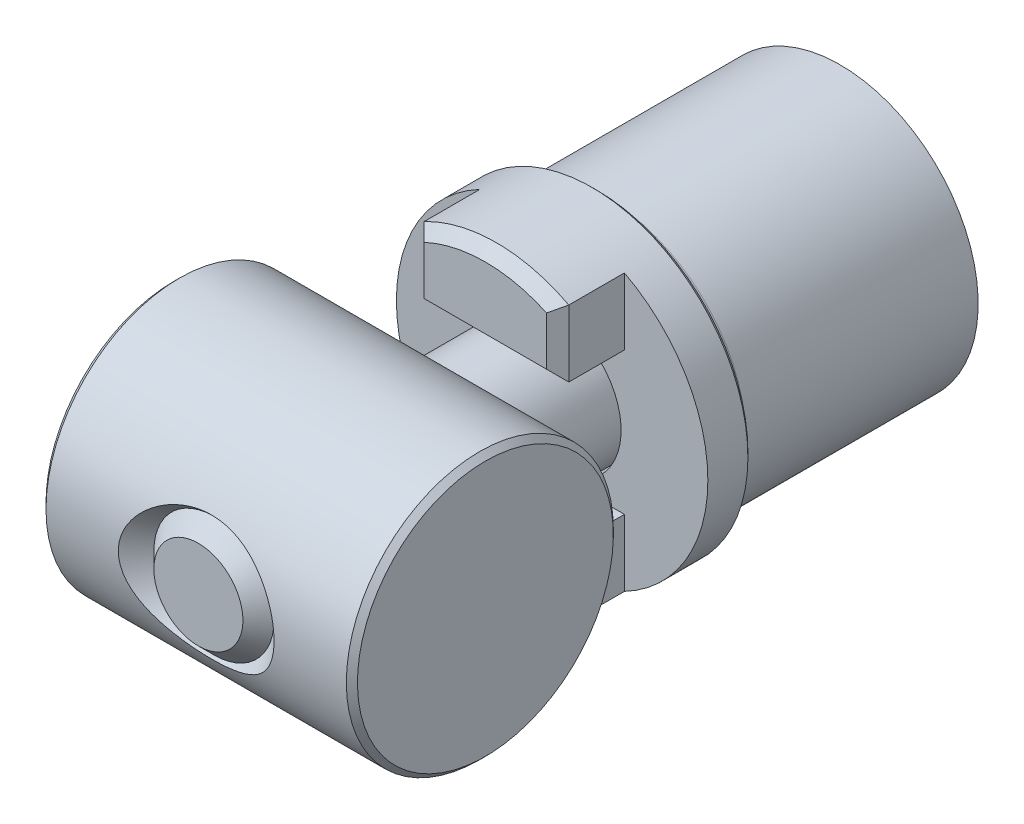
ISO-10303-21;
HEADER;
FILE_DESCRIPTION(('STEP AP214'),'2;1');
FILE_NAME('part.step','',(''),(''),'','','');
FILE_SCHEMA(('AUTOMOTIVE_DESIGN { 1 0 10303 214 1 1 1 1 }'));
ENDSEC;
DATA;
#1=APPLICATION_CONTEXT('core data for automotive mechanical design processes');
#2=APPLICATION_PROTOCOL_DEFINITION('international standard','automotive_design',2000,#1);
#3=PRODUCT_CONTEXT('',#1,'mechanical');
#4=PRODUCT('Part','Part','',(#3));
#5=PRODUCT_RELATED_PRODUCT_CATEGORY('part','',(#4));
#6=PRODUCT_DEFINITION_FORMATION('','',#4);
#7=PRODUCT_DEFINITION_CONTEXT('part definition',#1,'design');
#8=PRODUCT_DEFINITION('design','',#6,#7);
#9=PRODUCT_DEFINITION_SHAPE('','',#8);
#10=(LENGTH_UNIT() NAMED_UNIT(*) SI_UNIT(.MILLI.,.METRE.));
#11=(NAMED_UNIT(*) PLANE_ANGLE_UNIT() SI_UNIT($,.RADIAN.));
#12=(NAMED_UNIT(*) SI_UNIT($,.STERADIAN.) SOLID_ANGLE_UNIT());
#13=UNCERTAINTY_MEASURE_WITH_UNIT(LENGTH_MEASURE(1.E-05),#10,'distance_accuracy_value','');
#14=(GEOMETRIC_REPRESENTATION_CONTEXT(3) GLOBAL_UNCERTAINTY_ASSIGNED_CONTEXT((#13)) GLOBAL_UNIT_ASSIGNED_CONTEXT((#10,
#11,#12)) REPRESENTATION_CONTEXT('',''));
#15=CARTESIAN_POINT('',(0.,0.,0.));
#16=DIRECTION('',(0.,0.,1.));
#17=DIRECTION('',(1.,0.,0.));
#18=AXIS2_PLACEMENT_3D('',#15,#16,#17);
#19=CARTESIAN_POINT('',(0.,0.,8.85));
#20=DIRECTION('',(0.,0.,-1.));
#21=DIRECTION('',(1.,0.,0.));
#22=AXIS2_PLACEMENT_3D('',#19,#20,#21);
#23=CYLINDRICAL_SURFACE('',#22,3.);
#24=CARTESIAN_POINT('',(0.,0.,17.45));
#25=DIRECTION('',(0.,0.,-1.));
#26=DIRECTION('',(0.,-1.,0.));
#27=AXIS2_PLACEMENT_3D('',#24,#25,#26);
#28=CIRCLE('',#27,3.);
#29=CARTESIAN_POINT('',(1.80277563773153,-2.39791576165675,17.45));
#30=VERTEX_POINT('',#29);
#31=CARTESIAN_POINT('',(1.80277563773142,2.39791576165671,17.45));
#32=VERTEX_POINT('',#31);
#33=EDGE_CURVE('E155',#30,#32,#28,.F.);
#34=ORIENTED_EDGE('',*,*,#33,.F.);
#35=CARTESIAN_POINT('',(2.99999999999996,0.,16.9499999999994));
#36=CARTESIAN_POINT('',(2.99999916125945,0.0788941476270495,16.9500006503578));
#37=CARTESIAN_POINT('',(2.99688205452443,0.15779662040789,16.951561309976));
#38=CARTESIAN_POINT('',(2.98446072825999,0.315001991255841,16.9577564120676));
#39=CARTESIAN_POINT('',(2.97515372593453,0.393304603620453,16.9623922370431));
#40=CARTESIAN_POINT('',(2.93804214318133,0.62662869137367,16.9807802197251));
#41=CARTESIAN_POINT('',(2.90104717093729,0.779952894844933,16.9990126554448));
#42=CARTESIAN_POINT('',(2.80441822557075,1.07683586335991,17.045510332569));
#43=CARTESIAN_POINT('',(2.74487223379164,1.22043005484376,17.0737365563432));
#44=CARTESIAN_POINT('',(2.60528874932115,1.49540820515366,17.1376269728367));
#45=CARTESIAN_POINT('',(2.52525287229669,1.62679312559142,17.1732905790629));
#46=CARTESIAN_POINT('',(2.34144601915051,1.88252701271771,17.2513124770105));
#47=CARTESIAN_POINT('',(2.23653205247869,2.00596945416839,17.2939452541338));
#48=CARTESIAN_POINT('',(2.0084440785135,2.23433451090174,17.3801996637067));
#49=CARTESIAN_POINT('',(1.88525628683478,2.33924301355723,17.4238220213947));
#50=CARTESIAN_POINT('',(1.61251563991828,2.53576864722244,17.511036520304));
#51=CARTESIAN_POINT('',(1.46165902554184,2.62572411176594,17.5543639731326));
#52=CARTESIAN_POINT('',(1.22404914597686,2.74034031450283,17.6121755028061));
#53=CARTESIAN_POINT('',(1.14292907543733,2.77516786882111,17.6302542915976));
#54=CARTESIAN_POINT('',(0.977399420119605,2.8376929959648,17.6633423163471));
#55=CARTESIAN_POINT('',(0.892991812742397,2.86539478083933,17.6783533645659));
#56=CARTESIAN_POINT('',(0.726604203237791,2.91188280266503,17.703896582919));
#57=CARTESIAN_POINT('',(0.64477720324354,2.93110042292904,17.7146416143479));
#58=CARTESIAN_POINT('',(0.479445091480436,2.96263559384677,17.7324221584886));
#59=CARTESIAN_POINT('',(0.395940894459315,2.97495680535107,17.7394596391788));
#60=CARTESIAN_POINT('',(0.227993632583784,2.99251382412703,17.7495224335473));
#61=CARTESIAN_POINT('',(0.14355116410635,2.99775389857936,17.752550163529));
#62=CARTESIAN_POINT('',(-0.0254936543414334,3.00108452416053,17.7544744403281));
#63=CARTESIAN_POINT('',(-0.110095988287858,2.99917575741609,17.7533713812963));
#64=CARTESIAN_POINT('',(-0.342753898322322,2.98404973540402,17.7446533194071));
#65=CARTESIAN_POINT('',(-0.490244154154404,2.96335042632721,17.7327320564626));
#66=CARTESIAN_POINT('',(-0.779193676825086,2.90082280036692,17.6977181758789));
#67=CARTESIAN_POINT('',(-0.920651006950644,2.85898775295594,17.674621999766));
#68=CARTESIAN_POINT('',(-1.19767965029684,2.75462843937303,17.6193743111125));
#69=CARTESIAN_POINT('',(-1.33303711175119,2.69164495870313,17.5870244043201));
#70=CARTESIAN_POINT('',(-1.59190496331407,2.54712530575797,17.516898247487));
#71=CARTESIAN_POINT('',(-1.71540999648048,2.46558080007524,17.4791195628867));
#72=CARTESIAN_POINT('',(-1.96356309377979,2.27419808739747,17.3966051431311));
#73=CARTESIAN_POINT('',(-2.08637044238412,2.16208335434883,17.3515946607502));
#74=CARTESIAN_POINT('',(-2.31220643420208,1.91866675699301,17.2635713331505));
#75=CARTESIAN_POINT('',(-2.41522562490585,1.78735577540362,17.220559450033));
#76=CARTESIAN_POINT('',(-2.60305693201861,1.50154951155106,17.1389403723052));
#77=CARTESIAN_POINT('',(-2.68680140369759,1.34626077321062,17.1006304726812));
#78=CARTESIAN_POINT('',(-2.82629110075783,1.02139864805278,17.0352635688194));
#79=CARTESIAN_POINT('',(-2.88205855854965,0.85183672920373,17.0081976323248));
#80=CARTESIAN_POINT('',(-2.95942620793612,0.518299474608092,16.9702699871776));
#81=CARTESIAN_POINT('',(-2.98347370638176,0.355024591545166,16.9582518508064));
#82=CARTESIAN_POINT('',(-3.0043941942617,0.0263387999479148,16.9478095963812));
#83=CARTESIAN_POINT('',(-3.00128005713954,-0.139071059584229,16.9493790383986));
#84=CARTESIAN_POINT('',(-2.96937993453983,-0.453698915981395,16.9652642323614));
#85=CARTESIAN_POINT('',(-2.94260240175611,-0.603178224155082,16.9785826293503));
#86=CARTESIAN_POINT('',(-2.86728578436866,-0.895220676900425,17.0153348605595));
#87=CARTESIAN_POINT('',(-2.81874430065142,-1.03778305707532,17.0387698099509));
#88=CARTESIAN_POINT('',(-2.70000460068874,-1.31666582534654,17.0944724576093));
#89=CARTESIAN_POINT('',(-2.62922684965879,-1.45269119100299,17.1269735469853));
#90=CARTESIAN_POINT('',(-2.46867739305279,-1.71138408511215,17.1976807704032));
#91=CARTESIAN_POINT('',(-2.37889759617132,-1.83404588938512,17.2358893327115));
#92=CARTESIAN_POINT('',(-2.17271872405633,-2.07530306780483,17.3187533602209));
#93=CARTESIAN_POINT('',(-2.0545713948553,-2.19231623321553,17.3636734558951));
#94=CARTESIAN_POINT('',(-1.80022454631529,-2.40556896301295,17.4521282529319));
#95=CARTESIAN_POINT('',(-1.66401264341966,-2.5017941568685,17.495661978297));
#96=CARTESIAN_POINT('',(-1.36906903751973,-2.675123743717,17.578464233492));
#97=CARTESIAN_POINT('',(-1.20956620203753,-2.7510764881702,17.6174241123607));
#98=CARTESIAN_POINT('',(-0.877469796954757,-2.87424847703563,17.6827778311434));
#99=CARTESIAN_POINT('',(-0.7048934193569,-2.92150474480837,17.709187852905));
#100=CARTESIAN_POINT('',(-0.369269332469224,-2.98158506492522,17.7431549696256));
#101=CARTESIAN_POINT('',(-0.206897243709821,-2.99727899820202,17.7522784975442));
#102=CARTESIAN_POINT('',(0.118341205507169,-3.00206745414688,17.7550393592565));
#103=CARTESIAN_POINT('',(0.28120732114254,-2.99117350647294,17.7486834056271));
#104=CARTESIAN_POINT('',(0.586450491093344,-2.94577840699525,17.7228641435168));
#105=CARTESIAN_POINT('',(0.729301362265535,-2.91362505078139,17.7047071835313));
#106=CARTESIAN_POINT('',(1.00742440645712,-2.82952596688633,17.6588694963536));
#107=CARTESIAN_POINT('',(1.14269412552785,-2.77757387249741,17.6311857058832));
#108=CARTESIAN_POINT('',(1.41187436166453,-2.65144766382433,17.5671441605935));
#109=CARTESIAN_POINT('',(1.5450829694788,-2.57601505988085,17.5303286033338));
#110=CARTESIAN_POINT('',(1.79782434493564,-2.40645126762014,17.4529397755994));
#111=CARTESIAN_POINT('',(1.91734994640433,-2.31231035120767,17.4123645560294));
#112=CARTESIAN_POINT('',(2.15442285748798,-2.09461689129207,17.3261314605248));
#113=CARTESIAN_POINT('',(2.26996512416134,-1.96888052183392,17.2804550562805));
#114=CARTESIAN_POINT('',(2.47880114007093,-1.69843715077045,17.1936628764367));
#115=CARTESIAN_POINT('',(2.57208289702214,-1.55371998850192,17.1525495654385));
#116=CARTESIAN_POINT('',(2.69317818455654,-1.3245233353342,17.09748593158));
#117=CARTESIAN_POINT('',(2.73052020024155,-1.24575314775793,17.0801747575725));
#118=CARTESIAN_POINT('',(2.79836167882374,-1.08479725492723,17.0483115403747));
#119=CARTESIAN_POINT('',(2.82886449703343,-1.00261324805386,17.0337581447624));
#120=CARTESIAN_POINT('',(2.88260725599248,-0.835616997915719,17.0078730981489));
#121=CARTESIAN_POINT('',(2.90586304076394,-0.75081094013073,16.9965344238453));
#122=CARTESIAN_POINT('',(2.94488257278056,-0.579142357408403,16.9773922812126));
#123=CARTESIAN_POINT('',(2.96065089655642,-0.492281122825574,16.9695866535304));
#124=CARTESIAN_POINT('',(2.98168467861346,-0.337824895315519,16.9591417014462));
#125=CARTESIAN_POINT('',(2.98854691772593,-0.270495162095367,16.955719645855));
#126=CARTESIAN_POINT('',(2.99770500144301,-0.1354456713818,16.9511484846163));
#127=CARTESIAN_POINT('',(3.00000072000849,-0.0677259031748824,16.9499994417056));
#128=CARTESIAN_POINT('',(2.99999999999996,0.,16.9499999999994));
#129=B_SPLINE_CURVE_WITH_KNOTS('',3,(#35,#36,#37,#38,#39,#40,#41,#42,#43,#44,#45,#46,#47,#48,
#49,#50,#51,#52,#53,#54,#55,#56,#57,#58,#59,#60,#61,#62,#63,#64,#65,#66,#67,#68,#69,#70,#71,#72,
#73,#74,#75,#76,#77,#78,#79,#80,#81,#82,#83,#84,#85,#86,#87,#88,#89,#90,#91,#92,#93,#94,#95,#96,
#97,#98,#99,#100,#101,#102,#103,#104,#105,#106,#107,#108,#109,#110,#111,#112,#113,#114,#115,
#116,#117,#118,#119,#120,#121,#122,#123,#124,#125,#126,#127,#128),.UNSPECIFIED.,.T.,.F.,(4,2,2,
2,2,2,2,2,2,2,2,2,2,2,2,2,2,2,2,2,2,2,2,2,2,2,2,2,2,2,2,2,2,2,2,2,2,2,2,2,2,2,2,2,2,2,4),(0.,
0.23661143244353,0.47332931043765,0.94710098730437,1.41904300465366,1.89094781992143,
2.39140181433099,2.89223525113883,3.43190833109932,3.70192714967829,3.97178599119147,
4.22563720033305,4.47935352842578,4.73291689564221,4.98645606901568,5.43238672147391,
5.87845946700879,6.33492255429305,6.79159098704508,7.30616358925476,7.82098138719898,
8.3597060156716,8.89800185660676,9.39171406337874,9.88519228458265,10.340422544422,
10.7957029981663,11.2640010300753,11.7324988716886,12.2470036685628,12.7618630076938,
13.3016558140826,13.8407507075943,14.3280945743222,14.8152271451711,15.2559532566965,
15.6968212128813,16.1673090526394,16.6380421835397,17.1659726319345,17.6941868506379,
17.9605054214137,18.2266930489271,18.4922945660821,18.7577335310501,18.9608446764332,
19.1639614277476),.UNSPECIFIED.);
#130=CARTESIAN_POINT('',(-1.80277563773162,-2.39791576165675,17.45));
#131=VERTEX_POINT('',#130);
#132=EDGE_CURVE('E158',#131,#30,#129,.T.);
#133=ORIENTED_EDGE('',*,*,#132,.F.);
#134=CARTESIAN_POINT('',(-1.80277563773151,2.39791576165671,17.45));
#135=VERTEX_POINT('',#134);
#136=EDGE_CURVE('E165',#135,#131,#28,.F.);
#137=ORIENTED_EDGE('',*,*,#136,.F.);
#138=EDGE_CURVE('E161',#32,#135,#129,.T.);
#139=ORIENTED_EDGE('',*,*,#138,.F.);
#140=EDGE_LOOP('',(#34,#133,#137,#139));
#141=FACE_BOUND('',#140,.T.);
#142=CARTESIAN_POINT('',(0.,0.,10.95));
#143=DIRECTION('',(0.,0.,-1.));
#144=DIRECTION('',(-1.,0.,0.));
#145=AXIS2_PLACEMENT_3D('',#142,#143,#144);
#146=CIRCLE('',#145,3.);
#147=CARTESIAN_POINT('',(-3.00000000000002,0.,10.95));
#148=VERTEX_POINT('',#147);
#149=EDGE_CURVE('E18',#148,#148,#146,.F.);
#150=ORIENTED_EDGE('',*,*,#149,.T.);
#151=EDGE_LOOP('',(#150));
#152=FACE_BOUND('',#151,.T.);
#153=ADVANCED_FACE('F14',(#141,#152),#23,.T.);
#154=CARTESIAN_POINT('',(-7.0000000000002,0.,22.95));
#155=DIRECTION('',(-1.00000000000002,0.,0.));
#156=DIRECTION('',(0.,1.00000000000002,0.));
#157=AXIS2_PLACEMENT_3D('',#154,#155,#156);
#158=CONICAL_SURFACE('',#157,2.35,0.785398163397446);
#159=CARTESIAN_POINT('',(-7.0000000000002,0.,22.95));
#160=DIRECTION('',(-1.00000000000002,0.,0.));
#161=DIRECTION('',(0.,1.00000000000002,0.));
#162=AXIS2_PLACEMENT_3D('',#159,#160,#161);
#163=CIRCLE('',#162,2.35);
#164=CARTESIAN_POINT('',(-7.0000000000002,2.35000000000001,22.95));
#165=VERTEX_POINT('',#164);
#166=EDGE_CURVE('E391',#165,#165,#163,.T.);
#167=ORIENTED_EDGE('',*,*,#166,.T.);
#168=EDGE_LOOP('',(#167));
#169=FACE_BOUND('',#168,.T.);
#170=CARTESIAN_POINT('',(-6.5,0.,22.95));
#171=DIRECTION('',(1.,0.,0.));
#172=DIRECTION('',(0.,0.,-1.));
#173=AXIS2_PLACEMENT_3D('',#170,#171,#172);
#174=CIRCLE('',#173,1.84999999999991);
#175=CARTESIAN_POINT('',(-6.5,0.,21.1000000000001));
#176=VERTEX_POINT('',#175);
#177=EDGE_CURVE('E403',#176,#176,#174,.T.);
#178=ORIENTED_EDGE('',*,*,#177,.T.);
#179=EDGE_LOOP('',(#178));
#180=FACE_BOUND('',#179,.T.);
#181=ADVANCED_FACE('F204',(#169,#180),#158,.F.);
#182=CARTESIAN_POINT('',(2.99999999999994,0.,28.85));
#183=DIRECTION('',(0.,0.,1.));
#184=DIRECTION('',(-1.,0.,0.));
#185=AXIS2_PLACEMENT_3D('',#182,#183,#184);
#186=PLANE('',#185);
#187=CARTESIAN_POINT('',(0.,0.,28.85));
#188=DIRECTION('',(0.,0.,1.));
#189=DIRECTION('',(-1.,0.,0.));
#190=AXIS2_PLACEMENT_3D('',#187,#188,#189);
#191=CIRCLE('',#190,2.);
#192=CARTESIAN_POINT('',(-2.00000000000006,0.,28.85));
#193=VERTEX_POINT('',#192);
#194=EDGE_CURVE('E389',#193,#193,#191,.T.);
#195=ORIENTED_EDGE('',*,*,#194,.T.);
#196=EDGE_LOOP('',(#195));
#197=FACE_BOUND('',#196,.T.);
#198=ADVANCED_FACE('F207',(#197),#186,.T.);
#199=CARTESIAN_POINT('',(0.,0.,27.85));
#200=DIRECTION('',(0.,0.,-1.));
#201=DIRECTION('',(1.,0.,0.));
#202=AXIS2_PLACEMENT_3D('',#199,#200,#201);
#203=CONICAL_SURFACE('',#202,3.,0.785398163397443);
#204=ORIENTED_EDGE('',*,*,#194,.F.);
#205=EDGE_LOOP('',(#204));
#206=FACE_BOUND('',#205,.T.);
#207=CARTESIAN_POINT('',(0.,0.,28.15));
#208=DIRECTION('',(0.,0.,-1.));
#209=DIRECTION('',(-1.,0.,0.));
#210=AXIS2_PLACEMENT_3D('',#207,#208,#209);
#211=CIRCLE('',#210,2.7);
#212=CARTESIAN_POINT('',(-2.70000000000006,0.,28.15));
#213=VERTEX_POINT('',#212);
#214=EDGE_CURVE('E180',#213,#213,#211,.T.);
#215=ORIENTED_EDGE('',*,*,#214,.F.);
#216=EDGE_LOOP('',(#215));
#217=FACE_BOUND('',#216,.T.);
#218=ADVANCED_FACE('F215',(#206,#217),#203,.T.);
#219=CARTESIAN_POINT('',(-7.0000000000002,0.,22.95));
#220=DIRECTION('',(-1.00000000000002,0.,0.));
#221=DIRECTION('',(0.,1.00000000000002,0.));
#222=AXIS2_PLACEMENT_3D('',#219,#220,#221);
#223=PLANE('',#222);
#224=ORIENTED_EDGE('',*,*,#166,.F.);
#225=EDGE_LOOP('',(#224));
#226=FACE_BOUND('',#225,.T.);
#227=CARTESIAN_POINT('',(-7.0000000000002,0.,22.95));
#228=DIRECTION('',(-1.00000000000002,0.,0.));
#229=DIRECTION('',(0.,1.00000000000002,0.));
#230=AXIS2_PLACEMENT_3D('',#227,#228,#229);
#231=CIRCLE('',#230,5.75);
#232=CARTESIAN_POINT('',(-7.0000000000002,5.75000000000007,22.95));
#233=VERTEX_POINT('',#232);
#234=EDGE_CURVE('E178',#233,#233,#231,.T.);
#235=ORIENTED_EDGE('',*,*,#234,.T.);
#236=EDGE_LOOP('',(#235));
#237=FACE_BOUND('',#236,.T.);
#238=ADVANCED_FACE('F209',(#226,#237),#223,.T.);
#239=CARTESIAN_POINT('',(7.00000000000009,0.,22.95));
#240=DIRECTION('',(-1.00000000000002,0.,0.));
#241=DIRECTION('',(0.,1.00000000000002,0.));
#242=AXIS2_PLACEMENT_3D('',#239,#240,#241);
#243=PLANE('',#242);
#244=CARTESIAN_POINT('',(7.00000000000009,0.,22.95));
#245=DIRECTION('',(-1.00000000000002,0.,0.));
#246=DIRECTION('',(0.,1.00000000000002,0.));
#247=AXIS2_PLACEMENT_3D('',#244,#245,#246);
#248=CIRCLE('',#247,5.75);
#249=CARTESIAN_POINT('',(7.00000000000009,5.75000000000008,22.95));
#250=VERTEX_POINT('',#249);
#251=EDGE_CURVE('E788',#250,#250,#248,.F.);
#252=ORIENTED_EDGE('',*,*,#251,.T.);
#253=EDGE_LOOP('',(#252));
#254=FACE_BOUND('',#253,.T.);
#255=ADVANCED_FACE('F750',(#254),#243,.F.);
#256=CARTESIAN_POINT('',(-7.0000000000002,0.,22.95));
#257=DIRECTION('',(1.00000000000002,0.,0.));
#258=DIRECTION('',(0.,-1.00000000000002,0.));
#259=AXIS2_PLACEMENT_3D('',#256,#257,#258);
#260=CONICAL_SURFACE('',#259,5.75,0.785398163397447);
#261=CARTESIAN_POINT('',(-6.7500000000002,0.,22.95));
#262=DIRECTION('',(-1.00000000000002,0.,0.));
#263=DIRECTION('',(0.,1.00000000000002,0.));
#264=AXIS2_PLACEMENT_3D('',#261,#262,#263);
#265=CIRCLE('',#264,6.);
#266=CARTESIAN_POINT('',(-6.7500000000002,6.00000000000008,22.95));
#267=VERTEX_POINT('',#266);
#268=EDGE_CURVE('E395',#267,#267,#265,.F.);
#269=ORIENTED_EDGE('',*,*,#268,.F.);
#270=EDGE_LOOP('',(#269));
#271=FACE_BOUND('',#270,.T.);
#272=ORIENTED_EDGE('',*,*,#234,.F.);
#273=EDGE_LOOP('',(#272));
#274=FACE_BOUND('',#273,.T.);
#275=ADVANCED_FACE('F741',(#271,#274),#260,.T.);
#276=CARTESIAN_POINT('',(6.75000000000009,0.,22.95));
#277=DIRECTION('',(-1.00000000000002,0.,0.));
#278=DIRECTION('',(0.,1.00000000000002,0.));
#279=AXIS2_PLACEMENT_3D('',#276,#277,#278);
#280=CONICAL_SURFACE('',#279,6.,0.785398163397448);
#281=ORIENTED_EDGE('',*,*,#251,.F.);
#282=EDGE_LOOP('',(#281));
#283=FACE_BOUND('',#282,.T.);
#284=CARTESIAN_POINT('',(6.75000000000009,0.,22.95));
#285=DIRECTION('',(-1.00000000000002,0.,0.));
#286=DIRECTION('',(0.,1.00000000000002,0.));
#287=AXIS2_PLACEMENT_3D('',#284,#285,#286);
#288=CIRCLE('',#287,6.);
#289=CARTESIAN_POINT('',(6.75000000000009,6.00000000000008,22.95));
#290=VERTEX_POINT('',#289);
#291=EDGE_CURVE('E399',#290,#290,#288,.T.);
#292=ORIENTED_EDGE('',*,*,#291,.F.);
#293=EDGE_LOOP('',(#292));
#294=FACE_BOUND('',#293,.T.);
#295=ADVANCED_FACE('F733',(#283,#294),#280,.T.);
#296=CARTESIAN_POINT('',(-7.0000000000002,0.,22.95));
#297=DIRECTION('',(1.00000000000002,0.,0.));
#298=DIRECTION('',(0.,-1.00000000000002,0.));
#299=AXIS2_PLACEMENT_3D('',#296,#297,#298);
#300=CYLINDRICAL_SURFACE('',#299,6.);
#301=CARTESIAN_POINT('',(2.28742348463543,2.11452695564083,17.3349509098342));
#302=CARTESIAN_POINT('',(2.117153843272,2.23299654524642,17.3795602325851));
#303=CARTESIAN_POINT('',(1.93588592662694,2.33638090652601,17.4227390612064));
#304=CARTESIAN_POINT('',(1.55741095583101,2.51292711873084,17.5007308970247));
#305=CARTESIAN_POINT('',(1.36018364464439,2.58604981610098,17.5355330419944));
#306=CARTESIAN_POINT('',(0.95359572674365,2.7019527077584,17.5924184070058));
#307=CARTESIAN_POINT('',(0.74415642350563,2.74450535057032,17.6144060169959));
#308=CARTESIAN_POINT('',(0.320362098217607,2.7976871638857,17.6420935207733));
#309=CARTESIAN_POINT('',(0.106011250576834,2.80834249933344,17.6478067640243));
#310=CARTESIAN_POINT('',(-0.322542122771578,2.79756008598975,17.6421104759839));
#311=CARTESIAN_POINT('',(-0.536740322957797,2.77598866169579,17.6306296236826));
#312=CARTESIAN_POINT('',(-0.958181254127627,2.7009047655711,17.5921217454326));
#313=CARTESIAN_POINT('',(-1.16541778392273,2.64736457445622,17.5650812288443));
#314=CARTESIAN_POINT('',(-1.56796136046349,2.50872738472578,17.4991116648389));
#315=CARTESIAN_POINT('',(-1.76321783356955,2.42350607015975,17.4601358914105));
#316=CARTESIAN_POINT('',(-2.13530018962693,2.22178171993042,17.3754481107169));
#317=CARTESIAN_POINT('',(-2.3121387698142,2.10530043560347,17.3297407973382));
#318=CARTESIAN_POINT('',(-2.60180557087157,1.87209414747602,17.2485355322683));
#319=CARTESIAN_POINT('',(-2.71990830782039,1.76186487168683,17.2131637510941));
#320=CARTESIAN_POINT('',(-2.9370018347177,1.52321401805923,17.1452481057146));
#321=CARTESIAN_POINT('',(-3.03602386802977,1.39482278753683,17.1126996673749));
#322=CARTESIAN_POINT('',(-3.19213915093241,1.14858183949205,17.0599012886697));
#323=CARTESIAN_POINT('',(-3.25365940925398,1.03379871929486,17.0384943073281));
#324=CARTESIAN_POINT('',(-3.35788621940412,0.795032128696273,17.0016836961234));
#325=CARTESIAN_POINT('',(-3.40060581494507,0.671055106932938,16.9862759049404));
#326=CARTESIAN_POINT('',(-3.46452454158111,0.415997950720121,16.963062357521));
#327=CARTESIAN_POINT('',(-3.48557784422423,0.284875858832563,16.9553081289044));
#328=CARTESIAN_POINT('',(-3.50384996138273,0.0207609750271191,16.9485847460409));
#329=CARTESIAN_POINT('',(-3.50107867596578,-0.112231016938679,16.9496119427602));
#330=CARTESIAN_POINT('',(-3.47357635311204,-0.36096417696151,16.9597135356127));
#331=CARTESIAN_POINT('',(-3.45124582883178,-0.477018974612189,16.9679081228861));
#332=CARTESIAN_POINT('',(-3.3893523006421,-0.703782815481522,16.9903287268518));
#333=CARTESIAN_POINT('',(-3.34978658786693,-0.814491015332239,17.0045556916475));
#334=CARTESIAN_POINT('',(-3.25325140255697,-1.03371987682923,17.0386257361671));
#335=CARTESIAN_POINT('',(-3.19552031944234,-1.14186384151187,17.058711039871));
#336=CARTESIAN_POINT('',(-3.06610452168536,-1.34860203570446,17.102567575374));
#337=CARTESIAN_POINT('',(-2.99440951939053,-1.44718914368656,17.1263415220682));
#338=CARTESIAN_POINT('',(-2.80115522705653,-1.6803970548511,17.188301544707));
#339=CARTESIAN_POINT('',(-2.67245465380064,-1.80877283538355,17.2278074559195));
#340=CARTESIAN_POINT('',(-2.39554489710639,-2.04240082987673,17.3069621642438));
#341=CARTESIAN_POINT('',(-2.24730202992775,-2.14761226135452,17.3466110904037));
#342=CARTESIAN_POINT('',(-1.93366871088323,-2.33634553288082,17.4226151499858));
#343=CARTESIAN_POINT('',(-1.76805094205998,-2.4195115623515,17.458910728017));
#344=CARTESIAN_POINT('',(-1.42545864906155,-2.56192894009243,17.5238895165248));
#345=CARTESIAN_POINT('',(-1.24848797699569,-2.6211883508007,17.5525752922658));
#346=CARTESIAN_POINT('',(-0.964010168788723,-2.69536435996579,17.589413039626));
#347=CARTESIAN_POINT('',(-0.859002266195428,-2.71841873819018,17.6011078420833));
#348=CARTESIAN_POINT('',(-0.647186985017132,-2.7564588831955,17.6206097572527));
#349=CARTESIAN_POINT('',(-0.540380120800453,-2.77144691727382,17.6284179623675));
#350=CARTESIAN_POINT('',(-0.32569851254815,-2.79329025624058,17.6398512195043));
#351=CARTESIAN_POINT('',(-0.217823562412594,-2.80014395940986,17.6434754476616));
#352=CARTESIAN_POINT('',(-0.00180727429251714,-2.80567969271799,17.6464000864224));
#353=CARTESIAN_POINT('',(0.106334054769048,-2.80436199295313,17.6457006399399));
#354=CARTESIAN_POINT('',(0.3212494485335,-2.793604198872,17.6400271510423));
#355=CARTESIAN_POINT('',(0.42802759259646,-2.78422769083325,17.6350865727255));
#356=CARTESIAN_POINT('',(0.640347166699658,-2.75747988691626,17.6211604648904));
#357=CARTESIAN_POINT('',(0.745888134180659,-2.74010569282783,17.6121734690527));
#358=CARTESIAN_POINT('',(0.955011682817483,-2.69742362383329,17.5904775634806));
#359=CARTESIAN_POINT('',(1.05859350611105,-2.67211274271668,17.5777672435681));
#360=CARTESIAN_POINT('',(1.26306555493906,-2.613640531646,17.5490803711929));
#361=CARTESIAN_POINT('',(1.36395476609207,-2.58047628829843,17.533102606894));
#362=CARTESIAN_POINT('',(1.66309296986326,-2.46872681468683,17.4807890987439));
#363=CARTESIAN_POINT('',(1.85631222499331,-2.37818784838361,17.4402407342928));
#364=CARTESIAN_POINT('',(2.22309995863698,-2.16570919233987,17.3533197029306));
#365=CARTESIAN_POINT('',(2.39668617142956,-2.04379817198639,17.3069523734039));
#366=CARTESIAN_POINT('',(2.67575876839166,-1.80392219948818,17.2265857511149));
#367=CARTESIAN_POINT('',(2.78727645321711,-1.69300952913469,17.1924731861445));
#368=CARTESIAN_POINT('',(2.9913086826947,-1.45406544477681,17.1275475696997));
#369=CARTESIAN_POINT('',(3.08385430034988,-1.3260625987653,17.0967291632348));
#370=CARTESIAN_POINT('',(3.22940107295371,-1.08035724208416,17.0470022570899));
#371=CARTESIAN_POINT('',(3.28658092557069,-0.965374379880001,17.026943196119));
#372=CARTESIAN_POINT('',(3.38211282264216,-0.726933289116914,16.9929854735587));
#373=CARTESIAN_POINT('',(3.42047770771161,-0.603480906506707,16.9790826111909));
#374=CARTESIAN_POINT('',(3.47589107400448,-0.350413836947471,16.9588905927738));
#375=CARTESIAN_POINT('',(3.49281068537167,-0.220766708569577,16.9526474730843));
#376=CARTESIAN_POINT('',(3.50347650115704,0.0396013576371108,16.948720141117));
#377=CARTESIAN_POINT('',(3.49722961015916,0.170321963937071,16.9510333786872));
#378=CARTESIAN_POINT('',(3.46384581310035,0.415700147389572,16.9632783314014));
#379=CARTESIAN_POINT('',(3.43878623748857,0.530689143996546,16.9724521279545));
#380=CARTESIAN_POINT('',(3.37185177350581,0.75498851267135,16.9966202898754));
#381=CARTESIAN_POINT('',(3.32997198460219,0.86429721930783,17.0116163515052));
#382=CARTESIAN_POINT('',(3.22842965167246,1.08203071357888,17.047274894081));
#383=CARTESIAN_POINT('',(3.16779965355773,1.18995012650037,17.0682388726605));
#384=CARTESIAN_POINT('',(3.032708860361,1.39585831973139,17.1136727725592));
#385=CARTESIAN_POINT('',(2.95824419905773,1.49384431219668,17.1381436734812));
#386=CARTESIAN_POINT('',(2.79138080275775,1.68689094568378,17.1910747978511));
#387=CARTESIAN_POINT('',(2.69801684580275,1.78106813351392,17.2196976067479));
#388=CARTESIAN_POINT('',(2.50041031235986,1.95706282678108,17.2773914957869));
#389=CARTESIAN_POINT('',(2.39615958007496,2.03887095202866,17.3064628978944));
#390=CARTESIAN_POINT('',(2.28742348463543,2.11452695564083,17.3349509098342));
#391=B_SPLINE_CURVE_WITH_KNOTS('',3,(#301,#302,#303,#304,#305,#306,#307,#308,#309,#310,#311,
#312,#313,#314,#315,#316,#317,#318,#319,#320,#321,#322,#323,#324,#325,#326,#327,#328,#329,#330,
#331,#332,#333,#334,#335,#336,#337,#338,#339,#340,#341,#342,#343,#344,#345,#346,#347,#348,#349,
#350,#351,#352,#353,#354,#355,#356,#357,#358,#359,#360,#361,#362,#363,#364,#365,#366,#367,#368,
#369,#370,#371,#372,#373,#374,#375,#376,#377,#378,#379,#380,#381,#382,#383,#384,#385,#386,#387,
#388,#389,#390),.UNSPECIFIED.,.T.,.F.,(4,2,2,2,2,2,2,2,2,2,2,2,2,2,2,2,2,2,2,2,2,2,2,2,2,2,2,2,
2,2,2,2,2,2,2,2,2,2,2,2,2,2,2,2,4),(0.,0.636016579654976,1.27285350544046,1.91438301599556,
2.55538614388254,3.19905552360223,3.84328382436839,4.49006721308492,5.13640171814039,
5.63077975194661,6.12434126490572,6.51871725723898,6.91281920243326,7.30955670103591,
7.70612934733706,8.0599330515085,8.41379238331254,8.78509093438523,9.15666407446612,
9.71171478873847,10.267735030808,10.8322474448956,11.3965693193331,11.7206652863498,
12.0446701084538,12.3687387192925,12.6927966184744,13.0143208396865,13.3359616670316,
13.6577244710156,13.979606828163,14.6279339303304,15.2756706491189,15.7567811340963,
16.2370972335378,16.6254574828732,17.0135523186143,17.4039684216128,17.7942681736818,
18.1468462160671,18.4995270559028,18.8748049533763,19.2501878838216,19.6560489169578,
20.0622162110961),.UNSPECIFIED.);
#392=EDGE_CURVE('E170',#30,#32,#391,.T.);
#393=ORIENTED_EDGE('',*,*,#392,.T.);
#394=ORIENTED_EDGE('',*,*,#138,.T.);
#395=EDGE_CURVE('E172',#135,#131,#391,.T.);
#396=ORIENTED_EDGE('',*,*,#395,.T.);
#397=ORIENTED_EDGE('',*,*,#132,.T.);
#398=EDGE_LOOP('',(#393,#394,#396,#397));
#399=FACE_BOUND('',#398,.T.);
#400=CARTESIAN_POINT('',(2.28742348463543,2.11452695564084,28.5650490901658));
#401=CARTESIAN_POINT('',(2.41104036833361,2.02851846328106,28.5974367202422));
#402=CARTESIAN_POINT('',(2.52889430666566,1.93453569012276,28.6305862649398));
#403=CARTESIAN_POINT('',(2.7501626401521,1.73053859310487,28.696015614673));
#404=CARTESIAN_POINT('',(2.85358507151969,1.62053326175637,28.7282958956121));
#405=CARTESIAN_POINT('',(3.0336065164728,1.3955347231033,28.7864989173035));
#406=CARTESIAN_POINT('',(3.11178756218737,1.28189872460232,28.8127327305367));
#407=CARTESIAN_POINT('',(3.24945948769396,1.04271541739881,28.8599546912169));
#408=CARTESIAN_POINT('',(3.30895847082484,0.917173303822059,28.8809451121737));
#409=CARTESIAN_POINT('',(3.40586820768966,0.655400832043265,28.9155674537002));
#410=CARTESIAN_POINT('',(3.44307390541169,0.519083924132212,28.9291309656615));
#411=CARTESIAN_POINT('',(3.49124339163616,0.241311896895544,28.9467530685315));
#412=CARTESIAN_POINT('',(3.50223552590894,0.0998624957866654,28.9508219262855));
#413=CARTESIAN_POINT('',(3.49736985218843,-0.162159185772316,28.9490324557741));
#414=CARTESIAN_POINT('',(3.48512681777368,-0.282824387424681,28.9445105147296));
#415=CARTESIAN_POINT('',(3.44158759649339,-0.520168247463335,28.9285927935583));
#416=CARTESIAN_POINT('',(3.4102895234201,-0.63684650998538,28.9171963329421));
#417=CARTESIAN_POINT('',(3.3308689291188,-0.862726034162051,28.8887384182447));
#418=CARTESIAN_POINT('',(3.2828454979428,-0.971966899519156,28.8717103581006));
#419=CARTESIAN_POINT('',(3.17235514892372,-1.18203249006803,28.8333854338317));
#420=CARTESIAN_POINT('',(3.10987957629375,-1.28285212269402,28.8120860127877));
#421=CARTESIAN_POINT('',(2.94144519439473,-1.51917231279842,28.7562773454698));
#422=CARTESIAN_POINT('',(2.82866621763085,-1.64945032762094,28.7201812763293));
#423=CARTESIAN_POINT('',(2.58341694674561,-1.88932896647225,28.6461625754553));
#424=CARTESIAN_POINT('',(2.45091271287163,-1.99889319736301,28.6082368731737));
#425=CARTESIAN_POINT('',(2.16847348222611,-2.19891057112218,28.5335799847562));
#426=CARTESIAN_POINT('',(2.01828346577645,-2.28901246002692,28.4968794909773));
#427=CARTESIAN_POINT('',(1.70591983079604,-2.4478062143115,28.4286612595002));
#428=CARTESIAN_POINT('',(1.54374823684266,-2.51650168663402,28.3971426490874));
#429=CARTESIAN_POINT('',(1.27802087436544,-2.60889135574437,28.3532511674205));
#430=CARTESIAN_POINT('',(1.17724760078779,-2.63955469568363,28.3382872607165));
#431=CARTESIAN_POINT('',(0.973242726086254,-2.69315146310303,28.3117008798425));
#432=CARTESIAN_POINT('',(0.870011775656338,-2.71608691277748,28.3000775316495));
#433=CARTESIAN_POINT('',(0.661727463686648,-2.75416112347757,28.2805772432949));
#434=CARTESIAN_POINT('',(0.556673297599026,-2.7692963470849,28.2727020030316));
#435=CARTESIAN_POINT('',(0.345543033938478,-2.79168620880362,28.2609931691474));
#436=CARTESIAN_POINT('',(0.239467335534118,-2.7989438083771,28.2571580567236));
#437=CARTESIAN_POINT('',(0.0253701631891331,-2.80560206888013,28.2536414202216));
#438=CARTESIAN_POINT('',(-0.08265620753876,-2.80488055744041,28.2540244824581));
#439=CARTESIAN_POINT('',(-0.298245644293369,-2.79528999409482,28.2590848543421));
#440=CARTESIAN_POINT('',(-0.405808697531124,-2.78642071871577,28.2637622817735));
#441=CARTESIAN_POINT('',(-0.619724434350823,-2.7605737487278,28.2772363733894));
#442=CARTESIAN_POINT('',(-0.726076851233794,-2.74359430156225,28.2860339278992));
#443=CARTESIAN_POINT('',(-0.936807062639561,-2.70160249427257,28.3074141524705));
#444=CARTESIAN_POINT('',(-1.04118413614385,-2.67658725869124,28.3199981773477));
#445=CARTESIAN_POINT('',(-1.3490372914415,-2.58994472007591,28.3626150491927));
#446=CARTESIAN_POINT('',(-1.54866666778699,-2.51654757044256,28.3976125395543));
#447=CARTESIAN_POINT('',(-1.93173309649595,-2.33876125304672,28.4762644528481));
#448=CARTESIAN_POINT('',(-2.11517301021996,-2.23437757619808,28.5199173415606));
#449=CARTESIAN_POINT('',(-2.42798092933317,-2.01672814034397,28.6018767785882));
#450=CARTESIAN_POINT('',(-2.5610837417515,-1.90864432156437,28.6396860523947));
#451=CARTESIAN_POINT('',(-2.80794945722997,-1.67182673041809,28.7137076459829));
#452=CARTESIAN_POINT('',(-2.92174364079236,-1.54312702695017,28.7499224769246));
#453=CARTESIAN_POINT('',(-3.10195084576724,-1.29630370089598,28.8093492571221));
#454=CARTESIAN_POINT('',(-3.17328189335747,-1.18205054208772,28.8336710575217));
#455=CARTESIAN_POINT('',(-3.29716586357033,-0.942733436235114,28.8767181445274));
#456=CARTESIAN_POINT('',(-3.34973146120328,-0.817676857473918,28.8954472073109));
#457=CARTESIAN_POINT('',(-3.43294542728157,-0.558337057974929,28.9253994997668));
#458=CARTESIAN_POINT('',(-3.46341048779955,-0.423986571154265,28.9365599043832));
#459=CARTESIAN_POINT('',(-3.49903412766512,-0.15153766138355,28.9496309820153));
#460=CARTESIAN_POINT('',(-3.50421216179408,-0.0134422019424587,28.9515487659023));
#461=CARTESIAN_POINT('',(-3.48985603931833,0.24308694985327,28.946266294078));
#462=CARTESIAN_POINT('',(-3.47345758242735,0.361735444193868,28.9402228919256));
#463=CARTESIAN_POINT('',(-3.42240499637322,0.594469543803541,28.9216194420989));
#464=CARTESIAN_POINT('',(-3.38774864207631,0.708554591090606,28.9090586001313));
#465=CARTESIAN_POINT('',(-3.30152823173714,0.931509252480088,28.878337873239));
#466=CARTESIAN_POINT('',(-3.24968868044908,1.04025834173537,28.8600870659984));
#467=CARTESIAN_POINT('',(-3.13178533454,1.24889548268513,28.8195468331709));
#468=CARTESIAN_POINT('',(-3.06571221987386,1.34877766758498,28.7972547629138));
#469=CARTESIAN_POINT('',(-2.88750850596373,1.5840105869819,28.7389351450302));
#470=CARTESIAN_POINT('',(-2.76839581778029,1.71371759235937,28.7014073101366));
#471=CARTESIAN_POINT('',(-2.5105341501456,1.95147377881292,28.6251570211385));
#472=CARTESIAN_POINT('',(-2.37175105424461,2.05948452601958,28.5864325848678));
#473=CARTESIAN_POINT('',(-2.07679081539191,2.25540182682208,28.5109670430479));
#474=CARTESIAN_POINT('',(-1.92036628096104,2.34295062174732,28.4742687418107));
#475=CARTESIAN_POINT('',(-1.59582902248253,2.49563103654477,28.4069938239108));
#476=CARTESIAN_POINT('',(-1.42771919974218,2.56076819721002,28.3764156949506));
#477=CARTESIAN_POINT('',(-1.05292948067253,2.67782778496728,28.3197521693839));
#478=CARTESIAN_POINT('',(-0.844632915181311,2.72547007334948,28.2953779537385));
#479=CARTESIAN_POINT('',(-0.421986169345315,2.78888245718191,28.2625728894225));
#480=CARTESIAN_POINT('',(-0.207635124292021,2.80464797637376,28.2541443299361));
#481=CARTESIAN_POINT('',(0.221985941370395,2.8039774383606,28.2544993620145));
#482=CARTESIAN_POINT('',(0.437255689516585,2.78739403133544,28.2633617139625));
#483=CARTESIAN_POINT('',(0.861598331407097,2.72205834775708,28.2971230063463));
#484=CARTESIAN_POINT('',(1.07066996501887,2.67329957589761,28.3220251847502));
#485=CARTESIAN_POINT('',(1.45486429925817,2.55129450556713,28.3809229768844));
#486=CARTESIAN_POINT('',(1.63121525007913,2.48126040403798,28.4136465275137));
#487=CARTESIAN_POINT('',(1.97049313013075,2.31643921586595,28.4855388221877));
#488=CARTESIAN_POINT('',(2.13342991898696,2.22167052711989,28.5247027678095));
#489=CARTESIAN_POINT('',(2.28742348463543,2.11452695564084,28.5650490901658));
#490=B_SPLINE_CURVE_WITH_KNOTS('',3,(#400,#401,#402,#403,#404,#405,#406,#407,#408,#409,#410,
#411,#412,#413,#414,#415,#416,#417,#418,#419,#420,#421,#422,#423,#424,#425,#426,#427,#428,#429,
#430,#431,#432,#433,#434,#435,#436,#437,#438,#439,#440,#441,#442,#443,#444,#445,#446,#447,#448,
#449,#450,#451,#452,#453,#454,#455,#456,#457,#458,#459,#460,#461,#462,#463,#464,#465,#466,#467,
#468,#469,#470,#471,#472,#473,#474,#475,#476,#477,#478,#479,#480,#481,#482,#483,#484,#485,#486,
#487,#488,#489),.UNSPECIFIED.,.T.,.F.,(4,2,2,2,2,2,2,2,2,2,2,2,2,2,2,2,2,2,2,2,2,2,2,2,2,2,2,2,
2,2,2,2,2,2,2,2,2,2,2,2,2,2,2,2,4),(0.,0.461724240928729,0.923190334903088,1.34280421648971,
1.7622358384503,2.18546846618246,2.60824322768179,2.97056102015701,3.33291468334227,
3.69315709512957,4.05361580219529,4.57890222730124,5.10510314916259,5.64012725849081,
6.17506116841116,6.49392396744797,6.81270326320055,7.13162699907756,7.45043079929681,
7.77412264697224,8.09782337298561,8.42159408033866,8.74548077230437,9.38897249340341,
10.0323502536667,10.5571612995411,11.0811138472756,11.4901600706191,11.8989294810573,
12.3110517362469,12.7228568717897,13.0809400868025,13.4390669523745,13.803238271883,
14.1676487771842,14.7048802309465,15.2430551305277,15.7900333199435,16.3368761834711,
16.9790019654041,17.6212199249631,18.2663700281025,18.9116504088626,19.4872622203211,
20.0624470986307),.UNSPECIFIED.);
#491=CARTESIAN_POINT('',(2.28742348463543,2.11452695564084,28.5650490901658));
#492=VERTEX_POINT('',#491);
#493=EDGE_CURVE('E175',#492,#492,#490,.T.);
#494=ORIENTED_EDGE('',*,*,#493,.T.);
#495=EDGE_LOOP('',(#494));
#496=FACE_BOUND('',#495,.T.);
#497=ORIENTED_EDGE('',*,*,#291,.T.);
#498=EDGE_LOOP('',(#497));
#499=FACE_BOUND('',#498,.T.);
#500=ORIENTED_EDGE('',*,*,#268,.T.);
#501=EDGE_LOOP('',(#500));
#502=FACE_BOUND('',#501,.T.);
#503=ADVANCED_FACE('F168',(#399,#496,#499,#502),#300,.T.);
#504=CARTESIAN_POINT('',(0.,0.,27.95));
#505=DIRECTION('',(0.,0.,1.));
#506=DIRECTION('',(0.,1.00000000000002,0.));
#507=AXIS2_PLACEMENT_3D('',#504,#505,#506);
#508=CONICAL_SURFACE('',#507,2.5,0.785398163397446);
#509=ORIENTED_EDGE('',*,*,#214,.T.);
#510=EDGE_LOOP('',(#509));
#511=FACE_BOUND('',#510,.T.);
#512=ORIENTED_EDGE('',*,*,#493,.F.);
#513=EDGE_LOOP('',(#512));
#514=FACE_BOUND('',#513,.T.);
#515=ADVANCED_FACE('F200',(#511,#514),#508,.F.);
#516=CARTESIAN_POINT('',(0.,0.,16.95));
#517=DIRECTION('',(0.,0.,-1.));
#518=DIRECTION('',(0.,-1.00000000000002,0.));
#519=AXIS2_PLACEMENT_3D('',#516,#517,#518);
#520=CONICAL_SURFACE('',#519,3.5,0.785398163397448);
#521=ORIENTED_EDGE('',*,*,#395,.F.);
#522=ORIENTED_EDGE('',*,*,#136,.T.);
#523=EDGE_LOOP('',(#521,#522));
#524=FACE_BOUND('',#523,.T.);
#525=ADVANCED_FACE('F196',(#524),#520,.F.);
#526=ORIENTED_EDGE('',*,*,#392,.F.);
#527=ORIENTED_EDGE('',*,*,#33,.T.);
#528=EDGE_LOOP('',(#526,#527));
#529=FACE_BOUND('',#528,.T.);
#530=ADVANCED_FACE('F174',(#529),#520,.F.);
#531=CARTESIAN_POINT('',(-6.5,0.,22.95));
#532=DIRECTION('',(1.,0.,0.));
#533=DIRECTION('',(0.,-1.00000000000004,0.));
#534=AXIS2_PLACEMENT_3D('',#531,#532,#533);
#535=PLANE('',#534);
#536=DIRECTION('',(0.,-0.500000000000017,-0.86602540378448));
#537=VECTOR('',#536,1.);
#538=CARTESIAN_POINT('',(-6.5,1.15470053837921,22.95));
#539=LINE('',#538,#537);
#540=CARTESIAN_POINT('',(-6.5,1.15470053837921,22.95));
#541=VERTEX_POINT('',#540);
#542=CARTESIAN_POINT('',(-6.5,0.57735026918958,21.95));
#543=VERTEX_POINT('',#542);
#544=EDGE_CURVE('E433',#541,#543,#539,.T.);
#545=ORIENTED_EDGE('',*,*,#544,.F.);
#546=DIRECTION('',(0.,0.500000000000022,-0.866025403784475));
#547=VECTOR('',#546,1.);
#548=CARTESIAN_POINT('',(-6.5,0.577350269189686,23.95));
#549=LINE('',#548,#547);
#550=CARTESIAN_POINT('',(-6.5,0.577350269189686,23.95));
#551=VERTEX_POINT('',#550);
#552=EDGE_CURVE('E386',#551,#541,#549,.T.);
#553=ORIENTED_EDGE('',*,*,#552,.F.);
#554=DIRECTION('',(0.,1.00000000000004,0.));
#555=VECTOR('',#554,1.);
#556=CARTESIAN_POINT('',(-6.5,-0.577350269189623,23.95));
#557=LINE('',#556,#555);
#558=CARTESIAN_POINT('',(-6.5,-0.577350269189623,23.95));
#559=VERTEX_POINT('',#558);
#560=EDGE_CURVE('E420',#559,#551,#557,.T.);
#561=ORIENTED_EDGE('',*,*,#560,.F.);
#562=DIRECTION('',(0.,0.500000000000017,0.86602540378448));
#563=VECTOR('',#562,1.);
#564=CARTESIAN_POINT('',(-6.5,-1.15470053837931,22.95));
#565=LINE('',#564,#563);
#566=CARTESIAN_POINT('',(-6.5,-1.15470053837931,22.95));
#567=VERTEX_POINT('',#566);
#568=EDGE_CURVE('E423',#567,#559,#565,.T.);
#569=ORIENTED_EDGE('',*,*,#568,.F.);
#570=DIRECTION('',(0.,-0.500000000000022,0.866025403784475));
#571=VECTOR('',#570,1.);
#572=CARTESIAN_POINT('',(-6.5,-0.577350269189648,21.95));
#573=LINE('',#572,#571);
#574=CARTESIAN_POINT('',(-6.5,-0.577350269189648,21.95));
#575=VERTEX_POINT('',#574);
#576=EDGE_CURVE('E427',#575,#567,#573,.T.);
#577=ORIENTED_EDGE('',*,*,#576,.F.);
#578=DIRECTION('',(0.,-1.00000000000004,0.));
#579=VECTOR('',#578,1.);
#580=CARTESIAN_POINT('',(-6.5,0.57735026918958,21.95));
#581=LINE('',#580,#579);
#582=EDGE_CURVE('E430',#543,#575,#581,.T.);
#583=ORIENTED_EDGE('',*,*,#582,.F.);
#584=EDGE_LOOP('',(#545,#553,#561,#569,#577,#583));
#585=FACE_BOUND('',#584,.T.);
#586=ORIENTED_EDGE('',*,*,#177,.F.);
#587=EDGE_LOOP('',(#586));
#588=FACE_BOUND('',#587,.T.);
#589=ADVANCED_FACE('F210',(#585,#588),#535,.F.);
#590=CARTESIAN_POINT('',(-5.,0.577350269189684,23.95));
#591=DIRECTION('',(0.,0.866025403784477,0.500000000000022));
#592=DIRECTION('',(0.,0.500000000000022,-0.866025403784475));
#593=AXIS2_PLACEMENT_3D('',#590,#591,#592);
#594=PLANE('',#593);
#595=ORIENTED_EDGE('',*,*,#552,.T.);
#596=DIRECTION('',(-1.,0.,0.));
#597=VECTOR('',#596,1.);
#598=CARTESIAN_POINT('',(-5.00000000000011,1.15470053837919,22.95));
#599=LINE('',#598,#597);
#600=CARTESIAN_POINT('',(-5.00000000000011,1.15470053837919,22.95));
#601=VERTEX_POINT('',#600);
#602=EDGE_CURVE('E407',#601,#541,#599,.T.);
#603=ORIENTED_EDGE('',*,*,#602,.F.);
#604=DIRECTION('',(0.,0.500000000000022,-0.866025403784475));
#605=VECTOR('',#604,1.);
#606=CARTESIAN_POINT('',(-5.,0.577350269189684,23.95));
#607=LINE('',#606,#605);
#608=CARTESIAN_POINT('',(-5.,0.577350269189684,23.95));
#609=VERTEX_POINT('',#608);
#610=EDGE_CURVE('E424',#609,#601,#607,.T.);
#611=ORIENTED_EDGE('',*,*,#610,.F.);
#612=DIRECTION('',(-1.,0.,0.));
#613=VECTOR('',#612,1.);
#614=CARTESIAN_POINT('',(-5.,0.577350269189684,23.95));
#615=LINE('',#614,#613);
#616=EDGE_CURVE('E406',#609,#551,#615,.T.);
#617=ORIENTED_EDGE('',*,*,#616,.T.);
#618=EDGE_LOOP('',(#595,#603,#611,#617));
#619=FACE_BOUND('',#618,.T.);
#620=ADVANCED_FACE('F213',(#619),#594,.F.);
#621=CARTESIAN_POINT('',(-5.,-0.577350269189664,23.95));
#622=DIRECTION('',(0.,0.,1.00000000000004));
#623=DIRECTION('',(0.,1.00000000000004,0.));
#624=AXIS2_PLACEMENT_3D('',#621,#622,#623);
#625=PLANE('',#624);
#626=ORIENTED_EDGE('',*,*,#560,.T.);
#627=ORIENTED_EDGE('',*,*,#616,.F.);
#628=DIRECTION('',(0.,1.00000000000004,0.));
#629=VECTOR('',#628,1.);
#630=CARTESIAN_POINT('',(-5.,-0.577350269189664,23.95));
#631=LINE('',#630,#629);
#632=CARTESIAN_POINT('',(-5.,-0.577350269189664,23.95));
#633=VERTEX_POINT('',#632);
#634=EDGE_CURVE('E410',#633,#609,#631,.T.);
#635=ORIENTED_EDGE('',*,*,#634,.F.);
#636=DIRECTION('',(-1.,0.,0.));
#637=VECTOR('',#636,1.);
#638=CARTESIAN_POINT('',(-5.,-0.577350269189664,23.95));
#639=LINE('',#638,#637);
#640=EDGE_CURVE('E417',#633,#559,#639,.T.);
#641=ORIENTED_EDGE('',*,*,#640,.T.);
#642=EDGE_LOOP('',(#626,#627,#635,#641));
#643=FACE_BOUND('',#642,.T.);
#644=ADVANCED_FACE('F218',(#643),#625,.F.);
#645=CARTESIAN_POINT('',(-5.,-1.1547005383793,22.95));
#646=DIRECTION('',(0.,-0.866025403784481,0.500000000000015));
#647=DIRECTION('',(0.,0.500000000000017,0.86602540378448));
#648=AXIS2_PLACEMENT_3D('',#645,#646,#647);
#649=PLANE('',#648);
#650=ORIENTED_EDGE('',*,*,#568,.T.);
#651=ORIENTED_EDGE('',*,*,#640,.F.);
#652=DIRECTION('',(0.,0.500000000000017,0.86602540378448));
#653=VECTOR('',#652,1.);
#654=CARTESIAN_POINT('',(-5.,-1.1547005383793,22.95));
#655=LINE('',#654,#653);
#656=CARTESIAN_POINT('',(-5.,-1.1547005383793,22.95));
#657=VERTEX_POINT('',#656);
#658=EDGE_CURVE('E439',#657,#633,#655,.T.);
#659=ORIENTED_EDGE('',*,*,#658,.F.);
#660=DIRECTION('',(-1.,0.,0.));
#661=VECTOR('',#660,1.);
#662=CARTESIAN_POINT('',(-5.,-1.1547005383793,22.95));
#663=LINE('',#662,#661);
#664=EDGE_CURVE('E415',#657,#567,#663,.T.);
#665=ORIENTED_EDGE('',*,*,#664,.T.);
#666=EDGE_LOOP('',(#650,#651,#659,#665));
#667=FACE_BOUND('',#666,.T.);
#668=ADVANCED_FACE('F232',(#667),#649,.F.);
#669=CARTESIAN_POINT('',(-5.,-0.577350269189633,21.95));
#670=DIRECTION('',(0.,-0.866025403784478,-0.500000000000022));
#671=DIRECTION('',(0.,-0.500000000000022,0.866025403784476));
#672=AXIS2_PLACEMENT_3D('',#669,#670,#671);
#673=PLANE('',#672);
#674=ORIENTED_EDGE('',*,*,#576,.T.);
#675=ORIENTED_EDGE('',*,*,#664,.F.);
#676=DIRECTION('',(0.,-0.500000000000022,0.866025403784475));
#677=VECTOR('',#676,1.);
#678=CARTESIAN_POINT('',(-5.,-0.577350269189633,21.95));
#679=LINE('',#678,#677);
#680=CARTESIAN_POINT('',(-5.,-0.577350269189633,21.95));
#681=VERTEX_POINT('',#680);
#682=EDGE_CURVE('E442',#681,#657,#679,.T.);
#683=ORIENTED_EDGE('',*,*,#682,.F.);
#684=DIRECTION('',(-1.,0.,0.));
#685=VECTOR('',#684,1.);
#686=CARTESIAN_POINT('',(-5.,-0.577350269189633,21.95));
#687=LINE('',#686,#685);
#688=EDGE_CURVE('E413',#681,#575,#687,.T.);
#689=ORIENTED_EDGE('',*,*,#688,.T.);
#690=EDGE_LOOP('',(#674,#675,#683,#689));
#691=FACE_BOUND('',#690,.T.);
#692=ADVANCED_FACE('F228',(#691),#673,.F.);
#693=CARTESIAN_POINT('',(-5.,0.577350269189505,21.95));
#694=DIRECTION('',(0.,0.,-1.00000000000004));
#695=DIRECTION('',(0.,-1.00000000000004,0.));
#696=AXIS2_PLACEMENT_3D('',#693,#694,#695);
#697=PLANE('',#696);
#698=ORIENTED_EDGE('',*,*,#582,.T.);
#699=ORIENTED_EDGE('',*,*,#688,.F.);
#700=DIRECTION('',(0.,-1.00000000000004,0.));
#701=VECTOR('',#700,1.);
#702=CARTESIAN_POINT('',(-5.,0.577350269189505,21.95));
#703=LINE('',#702,#701);
#704=CARTESIAN_POINT('',(-5.,0.577350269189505,21.95));
#705=VERTEX_POINT('',#704);
#706=EDGE_CURVE('E445',#705,#681,#703,.T.);
#707=ORIENTED_EDGE('',*,*,#706,.F.);
#708=DIRECTION('',(-1.,0.,0.));
#709=VECTOR('',#708,1.);
#710=CARTESIAN_POINT('',(-5.,0.577350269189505,21.95));
#711=LINE('',#710,#709);
#712=EDGE_CURVE('E411',#705,#543,#711,.T.);
#713=ORIENTED_EDGE('',*,*,#712,.T.);
#714=EDGE_LOOP('',(#698,#699,#707,#713));
#715=FACE_BOUND('',#714,.T.);
#716=ADVANCED_FACE('F224',(#715),#697,.F.);
#717=CARTESIAN_POINT('',(-5.00000000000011,1.15470053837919,22.95));
#718=DIRECTION('',(0.,0.86602540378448,-0.500000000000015));
#719=DIRECTION('',(0.,-0.500000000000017,-0.86602540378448));
#720=AXIS2_PLACEMENT_3D('',#717,#718,#719);
#721=PLANE('',#720);
#722=ORIENTED_EDGE('',*,*,#544,.T.);
#723=ORIENTED_EDGE('',*,*,#712,.F.);
#724=DIRECTION('',(0.,-0.500000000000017,-0.86602540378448));
#725=VECTOR('',#724,1.);
#726=CARTESIAN_POINT('',(-5.00000000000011,1.15470053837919,22.95));
#727=LINE('',#726,#725);
#728=EDGE_CURVE('E448',#601,#705,#727,.T.);
#729=ORIENTED_EDGE('',*,*,#728,.F.);
#730=ORIENTED_EDGE('',*,*,#602,.T.);
#731=EDGE_LOOP('',(#722,#723,#729,#730));
#732=FACE_BOUND('',#731,.T.);
#733=ADVANCED_FACE('F220',(#732),#721,.F.);
#734=CARTESIAN_POINT('',(-5.,0.577350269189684,23.95));
#735=DIRECTION('',(1.,0.,0.));
#736=DIRECTION('',(0.,-1.00000000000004,0.));
#737=AXIS2_PLACEMENT_3D('',#734,#735,#736);
#738=PLANE('',#737);
#739=ORIENTED_EDGE('',*,*,#610,.T.);
#740=ORIENTED_EDGE('',*,*,#728,.T.);
#741=ORIENTED_EDGE('',*,*,#706,.T.);
#742=ORIENTED_EDGE('',*,*,#682,.T.);
#743=ORIENTED_EDGE('',*,*,#658,.T.);
#744=ORIENTED_EDGE('',*,*,#634,.T.);
#745=EDGE_LOOP('',(#739,#740,#741,#742,#743,#744));
#746=FACE_BOUND('',#745,.T.);
#747=ADVANCED_FACE('F223',(#746),#738,.F.);
#748=CARTESIAN_POINT('',(0.,0.,10.95));
#749=DIRECTION('',(0.,0.,-1.));
#750=DIRECTION('',(-1.,0.,0.));
#751=AXIS2_PLACEMENT_3D('',#748,#749,#750);
#752=PLANE('',#751);
#753=CARTESIAN_POINT('',(0.,0.,10.95));
#754=DIRECTION('',(0.,0.,-1.));
#755=DIRECTION('',(-1.,0.,0.));
#756=AXIS2_PLACEMENT_3D('',#753,#754,#755);
#757=CIRCLE('',#756,3.1);
#758=CARTESIAN_POINT('',(-3.1,0.,10.95));
#759=VERTEX_POINT('',#758);
#760=EDGE_CURVE('E387',#759,#759,#757,.T.);
#761=ORIENTED_EDGE('',*,*,#760,.F.);
#762=EDGE_LOOP('',(#761));
#763=FACE_BOUND('',#762,.T.);
#764=ORIENTED_EDGE('',*,*,#149,.F.);
#765=EDGE_LOOP('',(#764));
#766=FACE_BOUND('',#765,.T.);
#767=ADVANCED_FACE('F242',(#763,#766),#752,.F.);
#768=CARTESIAN_POINT('',(0.,0.,15.95));
#769=DIRECTION('',(0.,0.,1.));
#770=DIRECTION('',(-1.,0.,0.));
#771=AXIS2_PLACEMENT_3D('',#768,#769,#770);
#772=PLANE('',#771);
#773=DIRECTION('',(0.,1.,0.));
#774=VECTOR('',#773,1.);
#775=CARTESIAN_POINT('',(2.74999999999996,-3.2,15.95));
#776=LINE('',#775,#774);
#777=CARTESIAN_POINT('',(2.74999999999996,-5.88960949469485,15.95));
#778=VERTEX_POINT('',#777);
#779=CARTESIAN_POINT('',(2.74999999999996,-3.69999999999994,15.95));
#780=VERTEX_POINT('',#779);
#781=EDGE_CURVE('E502',#778,#780,#776,.T.);
#782=ORIENTED_EDGE('',*,*,#781,.T.);
#783=DIRECTION('',(-1.,0.,0.));
#784=VECTOR('',#783,1.);
#785=CARTESIAN_POINT('',(-3.25000000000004,-3.69999999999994,15.95));
#786=LINE('',#785,#784);
#787=CARTESIAN_POINT('',(-2.75000000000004,-3.69999999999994,15.95));
#788=VERTEX_POINT('',#787);
#789=EDGE_CURVE('E508',#780,#788,#786,.T.);
#790=ORIENTED_EDGE('',*,*,#789,.T.);
#791=DIRECTION('',(0.,-1.,0.));
#792=VECTOR('',#791,1.);
#793=CARTESIAN_POINT('',(-2.75000000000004,-6.19979838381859,15.95));
#794=LINE('',#793,#792);
#795=CARTESIAN_POINT('',(-2.75000000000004,-5.88960949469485,15.95));
#796=VERTEX_POINT('',#795);
#797=EDGE_CURVE('E506',#788,#796,#794,.T.);
#798=ORIENTED_EDGE('',*,*,#797,.T.);
#799=CARTESIAN_POINT('',(0.,0.,15.95));
#800=DIRECTION('',(0.,0.,1.));
#801=DIRECTION('',(-1.,0.,0.));
#802=AXIS2_PLACEMENT_3D('',#799,#800,#801);
#803=CIRCLE('',#802,6.5);
#804=EDGE_CURVE('E504',#796,#778,#803,.T.);
#805=ORIENTED_EDGE('',*,*,#804,.T.);
#806=EDGE_LOOP('',(#782,#790,#798,#805));
#807=FACE_BOUND('',#806,.T.);
#808=ADVANCED_FACE('F248',(#807),#772,.T.);
#809=CARTESIAN_POINT('',(0.,0.,15.95));
#810=DIRECTION('',(0.,0.,1.));
#811=DIRECTION('',(-1.,0.,0.));
#812=AXIS2_PLACEMENT_3D('',#809,#810,#811);
#813=PLANE('',#812);
#814=DIRECTION('',(0.,-1.,0.));
#815=VECTOR('',#814,1.);
#816=CARTESIAN_POINT('',(-2.75000000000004,3.2,15.95));
#817=LINE('',#816,#815);
#818=CARTESIAN_POINT('',(-2.75000000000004,5.88960949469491,15.95));
#819=VERTEX_POINT('',#818);
#820=CARTESIAN_POINT('',(-2.75000000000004,3.70000000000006,15.95));
#821=VERTEX_POINT('',#820);
#822=EDGE_CURVE('E550',#819,#821,#817,.T.);
#823=ORIENTED_EDGE('',*,*,#822,.T.);
#824=DIRECTION('',(1.,0.,0.));
#825=VECTOR('',#824,1.);
#826=CARTESIAN_POINT('',(3.25,3.70000000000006,15.95));
#827=LINE('',#826,#825);
#828=CARTESIAN_POINT('',(2.74999999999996,3.70000000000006,15.95));
#829=VERTEX_POINT('',#828);
#830=EDGE_CURVE('E525',#821,#829,#827,.T.);
#831=ORIENTED_EDGE('',*,*,#830,.T.);
#832=DIRECTION('',(0.,1.,0.));
#833=VECTOR('',#832,1.);
#834=CARTESIAN_POINT('',(2.74999999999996,6.19979838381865,15.95));
#835=LINE('',#834,#833);
#836=CARTESIAN_POINT('',(2.74999999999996,5.88960949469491,15.95));
#837=VERTEX_POINT('',#836);
#838=EDGE_CURVE('E546',#829,#837,#835,.T.);
#839=ORIENTED_EDGE('',*,*,#838,.T.);
#840=CARTESIAN_POINT('',(0.,0.,15.95));
#841=DIRECTION('',(0.,0.,1.));
#842=DIRECTION('',(-1.,0.,0.));
#843=AXIS2_PLACEMENT_3D('',#840,#841,#842);
#844=CIRCLE('',#843,6.5);
#845=EDGE_CURVE('E548',#837,#819,#844,.T.);
#846=ORIENTED_EDGE('',*,*,#845,.T.);
#847=EDGE_LOOP('',(#823,#831,#839,#846));
#848=FACE_BOUND('',#847,.T.);
#849=ADVANCED_FACE('F244',(#848),#813,.T.);
#850=CARTESIAN_POINT('',(2.74999999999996,0.,15.95));
#851=DIRECTION('',(0.707106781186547,0.,0.707106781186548));
#852=DIRECTION('',(-0.707106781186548,0.,0.707106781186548));
#853=AXIS2_PLACEMENT_3D('',#850,#851,#852);
#854=PLANE('',#853);
#855=CARTESIAN_POINT('',(3.25,6.19979838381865,15.45));
#856=CARTESIAN_POINT('',(3.16632172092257,6.14921255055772,15.5336782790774));
#857=CARTESIAN_POINT('',(3.08281594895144,6.09807058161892,15.6171840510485));
#858=CARTESIAN_POINT('',(2.91614928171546,5.9946742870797,15.7838507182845));
#859=CARTESIAN_POINT('',(2.83298838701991,5.94241995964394,15.86701161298));
#860=CARTESIAN_POINT('',(2.74999999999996,5.88960949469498,15.95));
#861=B_SPLINE_CURVE_WITH_KNOTS('',3,(#855,#856,#857,#858,#859,#860),.UNSPECIFIED.,.F.,.F.,(4,2,
4),(0.,0.386079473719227,0.77215958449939),.UNSPECIFIED.);
#862=CARTESIAN_POINT('',(3.25,6.19979838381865,15.45));
#863=VERTEX_POINT('',#862);
#864=EDGE_CURVE('E315',#863,#837,#861,.T.);
#865=ORIENTED_EDGE('',*,*,#864,.T.);
#866=ORIENTED_EDGE('',*,*,#838,.F.);
#867=DIRECTION('',(0.577350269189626,-0.577350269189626,-0.577350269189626));
#868=VECTOR('',#867,1.);
#869=CARTESIAN_POINT('',(3.98333333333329,2.4666666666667,14.7166666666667));
#870=LINE('',#869,#868);
#871=CARTESIAN_POINT('',(3.25,3.2,15.45));
#872=VERTEX_POINT('',#871);
#873=EDGE_CURVE('E364',#872,#829,#870,.F.);
#874=ORIENTED_EDGE('',*,*,#873,.F.);
#875=DIRECTION('',(0.,-1.,0.));
#876=VECTOR('',#875,1.);
#877=CARTESIAN_POINT('',(3.25,3.2,15.45));
#878=LINE('',#877,#876);
#879=EDGE_CURVE('E500',#863,#872,#878,.T.);
#880=ORIENTED_EDGE('',*,*,#879,.F.);
#881=EDGE_LOOP('',(#865,#866,#874,#880));
#882=FACE_BOUND('',#881,.T.);
#883=ADVANCED_FACE('F247',(#882),#854,.T.);
#884=CARTESIAN_POINT('',(2.74999999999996,0.,15.95));
#885=DIRECTION('',(0.707106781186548,0.,0.707106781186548));
#886=DIRECTION('',(-0.707106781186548,0.,0.707106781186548));
#887=AXIS2_PLACEMENT_3D('',#884,#885,#886);
#888=PLANE('',#887);
#889=CARTESIAN_POINT('',(2.74999999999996,-5.88960949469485,15.95));
#890=CARTESIAN_POINT('',(2.83298838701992,-5.94241995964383,15.86701161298));
#891=CARTESIAN_POINT('',(2.91614928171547,-5.99467428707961,15.7838507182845));
#892=CARTESIAN_POINT('',(3.08281594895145,-6.0980705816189,15.6171840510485));
#893=CARTESIAN_POINT('',(3.16632172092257,-6.14921255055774,15.5336782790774));
#894=CARTESIAN_POINT('',(3.25,-6.19979838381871,15.45));
#895=B_SPLINE_CURVE_WITH_KNOTS('',3,(#889,#890,#891,#892,#893,#894),.UNSPECIFIED.,.F.,.F.,(4,2,
4),(0.,0.386080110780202,0.772159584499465),.UNSPECIFIED.);
#896=CARTESIAN_POINT('',(3.25,-6.19979838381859,15.45));
#897=VERTEX_POINT('',#896);
#898=EDGE_CURVE('E357',#778,#897,#895,.T.);
#899=ORIENTED_EDGE('',*,*,#898,.T.);
#900=DIRECTION('',(0.,-1.,0.));
#901=VECTOR('',#900,1.);
#902=CARTESIAN_POINT('',(3.25,-6.19979838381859,15.45));
#903=LINE('',#902,#901);
#904=CARTESIAN_POINT('',(3.25,-3.2,15.45));
#905=VERTEX_POINT('',#904);
#906=EDGE_CURVE('E515',#905,#897,#903,.T.);
#907=ORIENTED_EDGE('',*,*,#906,.F.);
#908=DIRECTION('',(-0.577350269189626,-0.577350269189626,0.577350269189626));
#909=VECTOR('',#908,1.);
#910=CARTESIAN_POINT('',(3.98333333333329,-2.46666666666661,14.7166666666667));
#911=LINE('',#910,#909);
#912=EDGE_CURVE('E30',#780,#905,#911,.F.);
#913=ORIENTED_EDGE('',*,*,#912,.F.);
#914=ORIENTED_EDGE('',*,*,#781,.F.);
#915=EDGE_LOOP('',(#899,#907,#913,#914));
#916=FACE_BOUND('',#915,.T.);
#917=ADVANCED_FACE('F309',(#916),#888,.T.);
#918=CARTESIAN_POINT('',(0.,-3.69999999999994,15.95));
#919=DIRECTION('',(0.,0.707106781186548,0.707106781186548));
#920=DIRECTION('',(0.,-0.707106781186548,0.707106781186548));
#921=AXIS2_PLACEMENT_3D('',#918,#919,#920);
#922=PLANE('',#921);
#923=ORIENTED_EDGE('',*,*,#912,.T.);
#924=DIRECTION('',(1.,0.,0.));
#925=VECTOR('',#924,1.);
#926=CARTESIAN_POINT('',(3.25,-3.2,15.45));
#927=LINE('',#926,#925);
#928=CARTESIAN_POINT('',(-3.25,-3.2,15.45));
#929=VERTEX_POINT('',#928);
#930=EDGE_CURVE('E511',#929,#905,#927,.T.);
#931=ORIENTED_EDGE('',*,*,#930,.F.);
#932=DIRECTION('',(-0.577350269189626,0.577350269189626,-0.577350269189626));
#933=VECTOR('',#932,1.);
#934=CARTESIAN_POINT('',(-3.98333333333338,-2.46666666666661,14.7166666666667));
#935=LINE('',#934,#933);
#936=EDGE_CURVE('E333',#929,#788,#935,.F.);
#937=ORIENTED_EDGE('',*,*,#936,.T.);
#938=ORIENTED_EDGE('',*,*,#789,.F.);
#939=EDGE_LOOP('',(#923,#931,#937,#938));
#940=FACE_BOUND('',#939,.T.);
#941=ADVANCED_FACE('F339',(#940),#922,.T.);
#942=CARTESIAN_POINT('',(-2.75000000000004,0.,15.95));
#943=DIRECTION('',(-0.707106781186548,0.,0.707106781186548));
#944=DIRECTION('',(-0.707106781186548,0.,-0.707106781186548));
#945=AXIS2_PLACEMENT_3D('',#942,#943,#944);
#946=PLANE('',#945);
#947=CARTESIAN_POINT('',(-2.75000000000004,-5.88960949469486,15.95));
#948=CARTESIAN_POINT('',(-2.83298838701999,-5.94241995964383,15.86701161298));
#949=CARTESIAN_POINT('',(-2.91614928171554,-5.99467428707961,15.7838507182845));
#950=CARTESIAN_POINT('',(-3.08281594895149,-6.09807058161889,15.6171840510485));
#951=CARTESIAN_POINT('',(-3.1663217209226,-6.14921255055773,15.5336782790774));
#952=CARTESIAN_POINT('',(-3.25,-6.19979838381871,15.45));
#953=B_SPLINE_CURVE_WITH_KNOTS('',3,(#947,#948,#949,#950,#951,#952),.UNSPECIFIED.,.F.,.F.,(4,2,
4),(0.,0.386080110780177,0.772159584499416),.UNSPECIFIED.);
#954=CARTESIAN_POINT('',(-3.25,-6.19979838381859,15.45));
#955=VERTEX_POINT('',#954);
#956=EDGE_CURVE('E351',#955,#796,#953,.F.);
#957=ORIENTED_EDGE('',*,*,#956,.T.);
#958=ORIENTED_EDGE('',*,*,#797,.F.);
#959=ORIENTED_EDGE('',*,*,#936,.F.);
#960=DIRECTION('',(0.,1.,0.));
#961=VECTOR('',#960,1.);
#962=CARTESIAN_POINT('',(-3.25,-3.2,15.45));
#963=LINE('',#962,#961);
#964=EDGE_CURVE('E38',#955,#929,#963,.T.);
#965=ORIENTED_EDGE('',*,*,#964,.F.);
#966=EDGE_LOOP('',(#957,#958,#959,#965));
#967=FACE_BOUND('',#966,.T.);
#968=ADVANCED_FACE('F342',(#967),#946,.T.);
#969=CARTESIAN_POINT('',(0.,0.,15.95));
#970=DIRECTION('',(0.,0.,-1.));
#971=DIRECTION('',(1.,0.,0.));
#972=AXIS2_PLACEMENT_3D('',#969,#970,#971);
#973=CONICAL_SURFACE('',#972,6.5,0.785398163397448);
#974=ORIENTED_EDGE('',*,*,#956,.F.);
#975=CARTESIAN_POINT('',(0.,0.,15.45));
#976=DIRECTION('',(0.,0.,1.));
#977=DIRECTION('',(-1.,0.,0.));
#978=AXIS2_PLACEMENT_3D('',#975,#976,#977);
#979=CIRCLE('',#978,7.);
#980=EDGE_CURVE('E495',#897,#955,#979,.F.);
#981=ORIENTED_EDGE('',*,*,#980,.F.);
#982=ORIENTED_EDGE('',*,*,#898,.F.);
#983=ORIENTED_EDGE('',*,*,#804,.F.);
#984=EDGE_LOOP('',(#974,#981,#982,#983));
#985=FACE_BOUND('',#984,.T.);
#986=ADVANCED_FACE('F343',(#985),#973,.T.);
#987=CARTESIAN_POINT('',(0.,0.,15.95));
#988=DIRECTION('',(0.,0.,-1.));
#989=DIRECTION('',(1.,0.,0.));
#990=AXIS2_PLACEMENT_3D('',#987,#988,#989);
#991=CONICAL_SURFACE('',#990,6.5,0.785398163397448);
#992=ORIENTED_EDGE('',*,*,#864,.F.);
#993=CARTESIAN_POINT('',(0.,0.,15.45));
#994=DIRECTION('',(0.,0.,1.));
#995=DIRECTION('',(-1.,0.,0.));
#996=AXIS2_PLACEMENT_3D('',#993,#994,#995);
#997=CIRCLE('',#996,7.);
#998=CARTESIAN_POINT('',(-3.25,6.19979838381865,15.45));
#999=VERTEX_POINT('',#998);
#1000=EDGE_CURVE('E497',#999,#863,#997,.F.);
#1001=ORIENTED_EDGE('',*,*,#1000,.F.);
#1002=CARTESIAN_POINT('',(-3.25,6.19979838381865,15.45));
#1003=CARTESIAN_POINT('',(-3.1663217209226,6.14921255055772,15.5336782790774));
#1004=CARTESIAN_POINT('',(-3.08281594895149,6.09807058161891,15.6171840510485));
#1005=CARTESIAN_POINT('',(-2.91614928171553,5.99467428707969,15.7838507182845));
#1006=CARTESIAN_POINT('',(-2.83298838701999,5.94241995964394,15.8670116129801));
#1007=CARTESIAN_POINT('',(-2.75000000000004,5.88960949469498,15.95));
#1008=B_SPLINE_CURVE_WITH_KNOTS('',3,(#1002,#1003,#1004,#1005,#1006,#1007),.UNSPECIFIED.,.F.,
.F.,(4,2,4),(0.,0.386079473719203,0.772159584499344),.UNSPECIFIED.);
#1009=EDGE_CURVE('E323',#819,#999,#1008,.F.);
#1010=ORIENTED_EDGE('',*,*,#1009,.F.);
#1011=ORIENTED_EDGE('',*,*,#845,.F.);
#1012=EDGE_LOOP('',(#992,#1001,#1010,#1011));
#1013=FACE_BOUND('',#1012,.T.);
#1014=ADVANCED_FACE('F311',(#1013),#991,.T.);
#1015=CARTESIAN_POINT('',(-2.75000000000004,0.,15.95));
#1016=DIRECTION('',(-0.707106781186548,0.,0.707106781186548));
#1017=DIRECTION('',(-0.707106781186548,0.,-0.707106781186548));
#1018=AXIS2_PLACEMENT_3D('',#1015,#1016,#1017);
#1019=PLANE('',#1018);
#1020=ORIENTED_EDGE('',*,*,#1009,.T.);
#1021=DIRECTION('',(0.,1.,0.));
#1022=VECTOR('',#1021,1.);
#1023=CARTESIAN_POINT('',(-3.25,6.19979838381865,15.45));
#1024=LINE('',#1023,#1022);
#1025=CARTESIAN_POINT('',(-3.25,3.2,15.45));
#1026=VERTEX_POINT('',#1025);
#1027=EDGE_CURVE('E498',#1026,#999,#1024,.T.);
#1028=ORIENTED_EDGE('',*,*,#1027,.F.);
#1029=DIRECTION('',(0.577350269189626,0.577350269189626,0.577350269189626));
#1030=VECTOR('',#1029,1.);
#1031=CARTESIAN_POINT('',(-3.98333333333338,2.4666666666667,14.7166666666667));
#1032=LINE('',#1031,#1030);
#1033=EDGE_CURVE('E324',#821,#1026,#1032,.F.);
#1034=ORIENTED_EDGE('',*,*,#1033,.F.);
#1035=ORIENTED_EDGE('',*,*,#822,.F.);
#1036=EDGE_LOOP('',(#1020,#1028,#1034,#1035));
#1037=FACE_BOUND('',#1036,.T.);
#1038=ADVANCED_FACE('F304',(#1037),#1019,.T.);
#1039=CARTESIAN_POINT('',(0.,3.70000000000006,15.95));
#1040=DIRECTION('',(0.,-0.707106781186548,0.707106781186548));
#1041=DIRECTION('',(0.,-0.707106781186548,-0.707106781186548));
#1042=AXIS2_PLACEMENT_3D('',#1039,#1040,#1041);
#1043=PLANE('',#1042);
#1044=ORIENTED_EDGE('',*,*,#1033,.T.);
#1045=DIRECTION('',(-1.,0.,0.));
#1046=VECTOR('',#1045,1.);
#1047=CARTESIAN_POINT('',(-3.25,3.2,15.45));
#1048=LINE('',#1047,#1046);
#1049=EDGE_CURVE('E523',#872,#1026,#1048,.T.);
#1050=ORIENTED_EDGE('',*,*,#1049,.F.);
#1051=ORIENTED_EDGE('',*,*,#873,.T.);
#1052=ORIENTED_EDGE('',*,*,#830,.F.);
#1053=EDGE_LOOP('',(#1044,#1050,#1051,#1052));
#1054=FACE_BOUND('',#1053,.T.);
#1055=ADVANCED_FACE('F254',(#1054),#1043,.T.);
#1056=CARTESIAN_POINT('',(3.25,3.2,15.95));
#1057=DIRECTION('',(-1.,0.,0.));
#1058=DIRECTION('',(0.,1.,0.));
#1059=AXIS2_PLACEMENT_3D('',#1056,#1057,#1058);
#1060=PLANE('',#1059);
#1061=DIRECTION('',(0.,0.,-1.));
#1062=VECTOR('',#1061,1.);
#1063=CARTESIAN_POINT('',(3.25,6.19979838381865,15.95));
#1064=LINE('',#1063,#1062);
#1065=CARTESIAN_POINT('',(3.25,6.19979838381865,12.95));
#1066=VERTEX_POINT('',#1065);
#1067=EDGE_CURVE('E461',#863,#1066,#1064,.T.);
#1068=ORIENTED_EDGE('',*,*,#1067,.F.);
#1069=ORIENTED_EDGE('',*,*,#879,.T.);
#1070=DIRECTION('',(0.,0.,-1.));
#1071=VECTOR('',#1070,1.);
#1072=CARTESIAN_POINT('',(3.25,3.2,15.95));
#1073=LINE('',#1072,#1071);
#1074=CARTESIAN_POINT('',(3.25,3.2,12.95));
#1075=VERTEX_POINT('',#1074);
#1076=EDGE_CURVE('E463',#872,#1075,#1073,.T.);
#1077=ORIENTED_EDGE('',*,*,#1076,.T.);
#1078=DIRECTION('',(0.,1.,0.));
#1079=VECTOR('',#1078,1.);
#1080=CARTESIAN_POINT('',(3.25,3.2,12.95));
#1081=LINE('',#1080,#1079);
#1082=EDGE_CURVE('E458',#1075,#1066,#1081,.T.);
#1083=ORIENTED_EDGE('',*,*,#1082,.T.);
#1084=EDGE_LOOP('',(#1068,#1069,#1077,#1083));
#1085=FACE_BOUND('',#1084,.T.);
#1086=ADVANCED_FACE('F250',(#1085),#1060,.F.);
#1087=CARTESIAN_POINT('',(3.25,-6.19979838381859,15.95));
#1088=DIRECTION('',(-1.,0.,0.));
#1089=DIRECTION('',(0.,1.,0.));
#1090=AXIS2_PLACEMENT_3D('',#1087,#1088,#1089);
#1091=PLANE('',#1090);
#1092=DIRECTION('',(0.,0.,-1.));
#1093=VECTOR('',#1092,1.);
#1094=CARTESIAN_POINT('',(3.25,-3.2,15.95));
#1095=LINE('',#1094,#1093);
#1096=CARTESIAN_POINT('',(3.25,-3.2,12.95));
#1097=VERTEX_POINT('',#1096);
#1098=EDGE_CURVE('E563',#905,#1097,#1095,.T.);
#1099=ORIENTED_EDGE('',*,*,#1098,.F.);
#1100=ORIENTED_EDGE('',*,*,#906,.T.);
#1101=DIRECTION('',(0.,0.,-1.));
#1102=VECTOR('',#1101,1.);
#1103=CARTESIAN_POINT('',(3.25,-6.19979838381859,15.95));
#1104=LINE('',#1103,#1102);
#1105=CARTESIAN_POINT('',(3.25,-6.1997983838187,12.95));
#1106=VERTEX_POINT('',#1105);
#1107=EDGE_CURVE('E493',#897,#1106,#1104,.T.);
#1108=ORIENTED_EDGE('',*,*,#1107,.T.);
#1109=DIRECTION('',(0.,1.,0.));
#1110=VECTOR('',#1109,1.);
#1111=CARTESIAN_POINT('',(3.25,-6.1997983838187,12.95));
#1112=LINE('',#1111,#1110);
#1113=EDGE_CURVE('E469',#1106,#1097,#1112,.T.);
#1114=ORIENTED_EDGE('',*,*,#1113,.T.);
#1115=EDGE_LOOP('',(#1099,#1100,#1108,#1114));
#1116=FACE_BOUND('',#1115,.T.);
#1117=ADVANCED_FACE('F253',(#1116),#1091,.F.);
#1118=CARTESIAN_POINT('',(3.25,-3.2,15.95));
#1119=DIRECTION('',(0.,-1.,0.));
#1120=DIRECTION('',(0.,0.,-1.));
#1121=AXIS2_PLACEMENT_3D('',#1118,#1119,#1120);
#1122=PLANE('',#1121);
#1123=DIRECTION('',(0.,0.,-1.));
#1124=VECTOR('',#1123,1.);
#1125=CARTESIAN_POINT('',(-3.25000000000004,-3.2,15.95));
#1126=LINE('',#1125,#1124);
#1127=CARTESIAN_POINT('',(-3.25,-3.2,12.95));
#1128=VERTEX_POINT('',#1127);
#1129=EDGE_CURVE('E476',#929,#1128,#1126,.T.);
#1130=ORIENTED_EDGE('',*,*,#1129,.F.);
#1131=ORIENTED_EDGE('',*,*,#930,.T.);
#1132=ORIENTED_EDGE('',*,*,#1098,.T.);
#1133=DIRECTION('',(-1.,0.,0.));
#1134=VECTOR('',#1133,1.);
#1135=CARTESIAN_POINT('',(3.25,-3.2,12.95));
#1136=LINE('',#1135,#1134);
#1137=EDGE_CURVE('E470',#1097,#1128,#1136,.T.);
#1138=ORIENTED_EDGE('',*,*,#1137,.T.);
#1139=EDGE_LOOP('',(#1130,#1131,#1132,#1138));
#1140=FACE_BOUND('',#1139,.T.);
#1141=ADVANCED_FACE('F272',(#1140),#1122,.F.);
#1142=CARTESIAN_POINT('',(-3.25000000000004,-6.19979838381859,15.95));
#1143=DIRECTION('',(1.,0.,0.));
#1144=DIRECTION('',(0.,-1.,0.));
#1145=AXIS2_PLACEMENT_3D('',#1142,#1143,#1144);
#1146=PLANE('',#1145);
#1147=DIRECTION('',(0.,0.,-1.));
#1148=VECTOR('',#1147,1.);
#1149=CARTESIAN_POINT('',(-3.25000000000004,-6.19979838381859,15.95));
#1150=LINE('',#1149,#1148);
#1151=CARTESIAN_POINT('',(-3.25,-6.1997983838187,12.95));
#1152=VERTEX_POINT('',#1151);
#1153=EDGE_CURVE('E482',#955,#1152,#1150,.T.);
#1154=ORIENTED_EDGE('',*,*,#1153,.F.);
#1155=ORIENTED_EDGE('',*,*,#964,.T.);
#1156=ORIENTED_EDGE('',*,*,#1129,.T.);
#1157=DIRECTION('',(0.,-1.,0.));
#1158=VECTOR('',#1157,1.);
#1159=CARTESIAN_POINT('',(-3.25,-6.1997983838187,12.95));
#1160=LINE('',#1159,#1158);
#1161=EDGE_CURVE('E473',#1128,#1152,#1160,.T.);
#1162=ORIENTED_EDGE('',*,*,#1161,.T.);
#1163=EDGE_LOOP('',(#1154,#1155,#1156,#1162));
#1164=FACE_BOUND('',#1163,.T.);
#1165=ADVANCED_FACE('F269',(#1164),#1146,.F.);
#1166=CARTESIAN_POINT('',(0.,0.,12.95));
#1167=DIRECTION('',(0.,0.,-1.));
#1168=DIRECTION('',(1.,0.,0.));
#1169=AXIS2_PLACEMENT_3D('',#1166,#1167,#1168);
#1170=CYLINDRICAL_SURFACE('',#1169,7.);
#1171=CARTESIAN_POINT('',(0.,0.,11.15));
#1172=DIRECTION('',(0.,0.,1.));
#1173=DIRECTION('',(-1.,0.,0.));
#1174=AXIS2_PLACEMENT_3D('',#1171,#1172,#1173);
#1175=CIRCLE('',#1174,7.);
#1176=CARTESIAN_POINT('',(-7.00000000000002,0.,11.15));
#1177=VERTEX_POINT('',#1176);
#1178=EDGE_CURVE('E23',#1177,#1177,#1175,.T.);
#1179=ORIENTED_EDGE('',*,*,#1178,.T.);
#1180=EDGE_LOOP('',(#1179));
#1181=FACE_BOUND('',#1180,.T.);
#1182=DIRECTION('',(0.,0.,-1.));
#1183=VECTOR('',#1182,1.);
#1184=CARTESIAN_POINT('',(-3.25000000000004,6.19979838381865,15.95));
#1185=LINE('',#1184,#1183);
#1186=CARTESIAN_POINT('',(-3.25,6.19979838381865,12.95));
#1187=VERTEX_POINT('',#1186);
#1188=EDGE_CURVE('E467',#999,#1187,#1185,.T.);
#1189=ORIENTED_EDGE('',*,*,#1188,.F.);
#1190=ORIENTED_EDGE('',*,*,#1000,.T.);
#1191=ORIENTED_EDGE('',*,*,#1067,.T.);
#1192=CARTESIAN_POINT('',(0.,0.,12.95));
#1193=DIRECTION('',(0.,0.,1.));
#1194=DIRECTION('',(-1.,0.,0.));
#1195=AXIS2_PLACEMENT_3D('',#1192,#1193,#1194);
#1196=CIRCLE('',#1195,7.);
#1197=EDGE_CURVE('E542',#1106,#1066,#1196,.T.);
#1198=ORIENTED_EDGE('',*,*,#1197,.F.);
#1199=ORIENTED_EDGE('',*,*,#1107,.F.);
#1200=ORIENTED_EDGE('',*,*,#980,.T.);
#1201=ORIENTED_EDGE('',*,*,#1153,.T.);
#1202=EDGE_CURVE('E487',#1187,#1152,#1196,.T.);
#1203=ORIENTED_EDGE('',*,*,#1202,.F.);
#1204=EDGE_LOOP('',(#1189,#1190,#1191,#1198,#1199,#1200,#1201,#1203));
#1205=FACE_BOUND('',#1204,.T.);
#1206=ADVANCED_FACE('F264',(#1181,#1205),#1170,.T.);
#1207=CARTESIAN_POINT('',(-3.25000000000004,3.2,15.95));
#1208=DIRECTION('',(1.,0.,0.));
#1209=DIRECTION('',(0.,-1.,0.));
#1210=AXIS2_PLACEMENT_3D('',#1207,#1208,#1209);
#1211=PLANE('',#1210);
#1212=DIRECTION('',(0.,0.,-1.));
#1213=VECTOR('',#1212,1.);
#1214=CARTESIAN_POINT('',(-3.25000000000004,3.2,15.95));
#1215=LINE('',#1214,#1213);
#1216=CARTESIAN_POINT('',(-3.25,3.2,12.95));
#1217=VERTEX_POINT('',#1216);
#1218=EDGE_CURVE('E465',#1026,#1217,#1215,.T.);
#1219=ORIENTED_EDGE('',*,*,#1218,.F.);
#1220=ORIENTED_EDGE('',*,*,#1027,.T.);
#1221=ORIENTED_EDGE('',*,*,#1188,.T.);
#1222=DIRECTION('',(0.,-1.,0.));
#1223=VECTOR('',#1222,1.);
#1224=CARTESIAN_POINT('',(-3.25,3.2,12.95));
#1225=LINE('',#1224,#1223);
#1226=EDGE_CURVE('E332',#1187,#1217,#1225,.T.);
#1227=ORIENTED_EDGE('',*,*,#1226,.T.);
#1228=EDGE_LOOP('',(#1219,#1220,#1221,#1227));
#1229=FACE_BOUND('',#1228,.T.);
#1230=ADVANCED_FACE('F260',(#1229),#1211,.F.);
#1231=CARTESIAN_POINT('',(3.25,3.2,15.95));
#1232=DIRECTION('',(0.,1.,0.));
#1233=DIRECTION('',(1.,0.,0.));
#1234=AXIS2_PLACEMENT_3D('',#1231,#1232,#1233);
#1235=PLANE('',#1234);
#1236=ORIENTED_EDGE('',*,*,#1076,.F.);
#1237=ORIENTED_EDGE('',*,*,#1049,.T.);
#1238=ORIENTED_EDGE('',*,*,#1218,.T.);
#1239=DIRECTION('',(1.,0.,0.));
#1240=VECTOR('',#1239,1.);
#1241=CARTESIAN_POINT('',(3.25,3.2,12.95));
#1242=LINE('',#1241,#1240);
#1243=EDGE_CURVE('E455',#1217,#1075,#1242,.T.);
#1244=ORIENTED_EDGE('',*,*,#1243,.T.);
#1245=EDGE_LOOP('',(#1236,#1237,#1238,#1244));
#1246=FACE_BOUND('',#1245,.T.);
#1247=ADVANCED_FACE('F256',(#1246),#1235,.F.);
#1248=CARTESIAN_POINT('',(0.,0.,12.95));
#1249=DIRECTION('',(0.,0.,1.));
#1250=DIRECTION('',(-1.,0.,0.));
#1251=AXIS2_PLACEMENT_3D('',#1248,#1249,#1250);
#1252=PLANE('',#1251);
#1253=CARTESIAN_POINT('',(0.,0.,12.95));
#1254=DIRECTION('',(0.,0.,1.));
#1255=DIRECTION('',(-1.,0.,0.));
#1256=AXIS2_PLACEMENT_3D('',#1253,#1254,#1255);
#1257=CIRCLE('',#1256,3.1);
#1258=CARTESIAN_POINT('',(-3.10000000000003,0.,12.95));
#1259=VERTEX_POINT('',#1258);
#1260=EDGE_CURVE('E557',#1259,#1259,#1257,.T.);
#1261=ORIENTED_EDGE('',*,*,#1260,.F.);
#1262=EDGE_LOOP('',(#1261));
#1263=FACE_BOUND('',#1262,.T.);
#1264=ORIENTED_EDGE('',*,*,#1243,.F.);
#1265=ORIENTED_EDGE('',*,*,#1226,.F.);
#1266=ORIENTED_EDGE('',*,*,#1202,.T.);
#1267=ORIENTED_EDGE('',*,*,#1161,.F.);
#1268=ORIENTED_EDGE('',*,*,#1137,.F.);
#1269=ORIENTED_EDGE('',*,*,#1113,.F.);
#1270=ORIENTED_EDGE('',*,*,#1197,.T.);
#1271=ORIENTED_EDGE('',*,*,#1082,.F.);
#1272=EDGE_LOOP('',(#1264,#1265,#1266,#1267,#1268,#1269,#1270,#1271));
#1273=FACE_BOUND('',#1272,.T.);
#1274=ADVANCED_FACE('F259',(#1263,#1273),#1252,.T.);
#1275=CARTESIAN_POINT('',(0.,0.,1.15));
#1276=DIRECTION('',(0.,0.,1.));
#1277=DIRECTION('',(-1.,0.,0.));
#1278=AXIS2_PLACEMENT_3D('',#1275,#1276,#1277);
#1279=CYLINDRICAL_SURFACE('',#1278,3.1);
#1280=ORIENTED_EDGE('',*,*,#1260,.T.);
#1281=EDGE_LOOP('',(#1280));
#1282=FACE_BOUND('',#1281,.T.);
#1283=ORIENTED_EDGE('',*,*,#760,.T.);
#1284=EDGE_LOOP('',(#1283));
#1285=FACE_BOUND('',#1284,.T.);
#1286=ADVANCED_FACE('F281',(#1282,#1285),#1279,.F.);
#1287=CARTESIAN_POINT('',(0.,0.,11.15));
#1288=DIRECTION('',(0.,0.,1.));
#1289=DIRECTION('',(-1.,0.,0.));
#1290=AXIS2_PLACEMENT_3D('',#1287,#1288,#1289);
#1291=CONICAL_SURFACE('',#1290,7.,0.785398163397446);
#1292=CARTESIAN_POINT('',(0.,0.,10.95));
#1293=DIRECTION('',(0.,0.,1.));
#1294=DIRECTION('',(-1.,0.,0.));
#1295=AXIS2_PLACEMENT_3D('',#1292,#1293,#1294);
#1296=CIRCLE('',#1295,6.8);
#1297=CARTESIAN_POINT('',(-6.80000000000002,0.,10.95));
#1298=VERTEX_POINT('',#1297);
#1299=EDGE_CURVE('E9',#1298,#1298,#1296,.F.);
#1300=ORIENTED_EDGE('',*,*,#1299,.F.);
#1301=EDGE_LOOP('',(#1300));
#1302=FACE_BOUND('',#1301,.T.);
#1303=ORIENTED_EDGE('',*,*,#1178,.F.);
#1304=EDGE_LOOP('',(#1303));
#1305=FACE_BOUND('',#1304,.T.);
#1306=ADVANCED_FACE('F16',(#1302,#1305),#1291,.T.);
#1307=CARTESIAN_POINT('',(0.,0.,10.95));
#1308=DIRECTION('',(0.,0.,1.));
#1309=DIRECTION('',(-1.,0.,0.));
#1310=AXIS2_PLACEMENT_3D('',#1307,#1308,#1309);
#1311=PLANE('',#1310);
#1312=ORIENTED_EDGE('',*,*,#1299,.T.);
#1313=EDGE_LOOP('',(#1312));
#1314=FACE_BOUND('',#1313,.T.);
#1315=CARTESIAN_POINT('',(0.,0.,10.95));
#1316=DIRECTION('',(0.,0.,1.));
#1317=DIRECTION('',(-1.,0.,0.));
#1318=AXIS2_PLACEMENT_3D('',#1315,#1316,#1317);
#1319=CIRCLE('',#1318,6.7);
#1320=CARTESIAN_POINT('',(-6.70000000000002,0.,10.95));
#1321=VERTEX_POINT('',#1320);
#1322=EDGE_CURVE('E558',#1321,#1321,#1319,.T.);
#1323=ORIENTED_EDGE('',*,*,#1322,.T.);
#1324=EDGE_LOOP('',(#1323));
#1325=FACE_BOUND('',#1324,.T.);
#1326=ADVANCED_FACE('F283',(#1314,#1325),#1311,.F.);
#1327=CARTESIAN_POINT('',(0.,0.,10.45));
#1328=DIRECTION('',(0.,0.,1.));
#1329=DIRECTION('',(-1.,0.,0.));
#1330=AXIS2_PLACEMENT_3D('',#1327,#1328,#1329);
#1331=TOROIDAL_SURFACE('',#1330,6.7,0.5);
#1332=CARTESIAN_POINT('',(0.,0.,10.45));
#1333=DIRECTION('',(0.,0.,1.));
#1334=DIRECTION('',(-1.,0.,0.));
#1335=AXIS2_PLACEMENT_3D('',#1332,#1333,#1334);
#1336=CIRCLE('',#1335,6.2);
#1337=CARTESIAN_POINT('',(-6.20000000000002,0.,10.45));
#1338=VERTEX_POINT('',#1337);
#1339=EDGE_CURVE('E549',#1338,#1338,#1336,.F.);
#1340=ORIENTED_EDGE('',*,*,#1339,.F.);
#1341=EDGE_LOOP('',(#1340));
#1342=FACE_BOUND('',#1341,.T.);
#1343=ORIENTED_EDGE('',*,*,#1322,.F.);
#1344=EDGE_LOOP('',(#1343));
#1345=FACE_BOUND('',#1344,.T.);
#1346=ADVANCED_FACE('F286',(#1342,#1345),#1331,.F.);
#1347=CARTESIAN_POINT('',(0.,0.,1.15));
#1348=DIRECTION('',(0.,0.,1.));
#1349=DIRECTION('',(-1.,0.,0.));
#1350=AXIS2_PLACEMENT_3D('',#1347,#1348,#1349);
#1351=CYLINDRICAL_SURFACE('',#1350,6.2);
#1352=ORIENTED_EDGE('',*,*,#1339,.T.);
#1353=EDGE_LOOP('',(#1352));
#1354=FACE_BOUND('',#1353,.T.);
#1355=CARTESIAN_POINT('',(0.,0.,0.));
#1356=DIRECTION('',(0.,0.,-1.));
#1357=DIRECTION('',(-1.,0.,0.));
#1358=AXIS2_PLACEMENT_3D('',#1355,#1356,#1357);
#1359=CIRCLE('',#1358,6.2);
#1360=CARTESIAN_POINT('',(-6.2,0.,0.));
#1361=VERTEX_POINT('',#1360);
#1362=EDGE_CURVE('E907',#1361,#1361,#1359,.T.);
#1363=ORIENTED_EDGE('',*,*,#1362,.F.);
#1364=EDGE_LOOP('',(#1363));
#1365=FACE_BOUND('',#1364,.T.);
#1366=ADVANCED_FACE('F294',(#1354,#1365),#1351,.T.);
#1367=CARTESIAN_POINT('',(0.,0.,0.));
#1368=DIRECTION('',(0.,0.,-1.));
#1369=DIRECTION('',(-1.,0.,0.));
#1370=AXIS2_PLACEMENT_3D('',#1367,#1368,#1369);
#1371=PLANE('',#1370);
#1372=ORIENTED_EDGE('',*,*,#1362,.T.);
#1373=EDGE_LOOP('',(#1372));
#1374=FACE_BOUND('',#1373,.T.);
#1375=ADVANCED_FACE('F297',(#1374),#1371,.T.);
#1376=CLOSED_SHELL('',(#153,#181,#198,#218,#238,#255,#275,#295,#503,#515,#525,#530,#589,#620,
#644,#668,#692,#716,#733,#747,#767,#808,#849,#883,#917,#941,#968,#986,#1014,#1038,#1055,#1086,
#1117,#1141,#1165,#1206,#1230,#1247,#1274,#1286,#1306,#1326,#1346,#1366,#1375));
#1377=MANIFOLD_SOLID_BREP('B1',#1376);
#1378=ADVANCED_BREP_SHAPE_REPRESENTATION('',(#18,#1377),#14);
#1379=SHAPE_DEFINITION_REPRESENTATION(#9,#1378);
ENDSEC;
END-ISO-10303-21;
